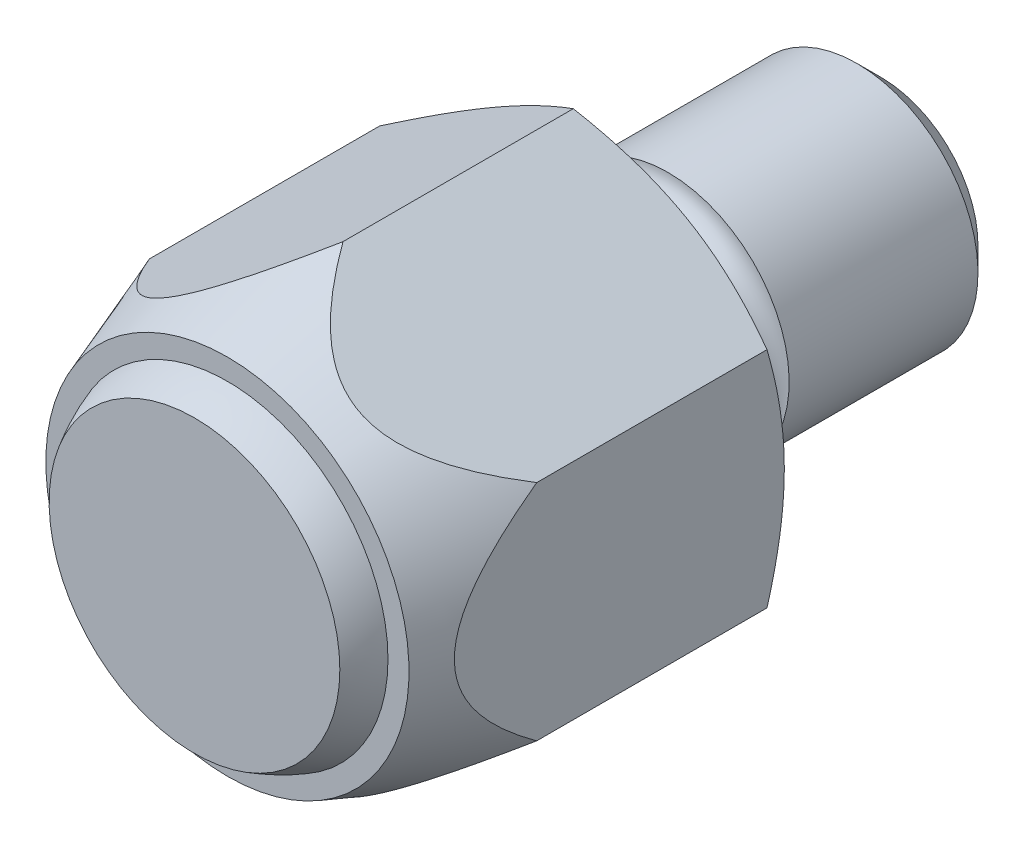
ISO-10303-21;
HEADER;
FILE_DESCRIPTION(('STEP AP214'),'2;1');
FILE_NAME('part.step','',(''),(''),'','','');
FILE_SCHEMA(('AUTOMOTIVE_DESIGN { 1 0 10303 214 1 1 1 1 }'));
ENDSEC;
DATA;
#1=APPLICATION_CONTEXT('core data for automotive mechanical design processes');
#2=APPLICATION_PROTOCOL_DEFINITION('international standard','automotive_design',2000,#1);
#3=PRODUCT_CONTEXT('',#1,'mechanical');
#4=PRODUCT('Part','Part','',(#3));
#5=PRODUCT_RELATED_PRODUCT_CATEGORY('part','',(#4));
#6=PRODUCT_DEFINITION_FORMATION('','',#4);
#7=PRODUCT_DEFINITION_CONTEXT('part definition',#1,'design');
#8=PRODUCT_DEFINITION('design','',#6,#7);
#9=PRODUCT_DEFINITION_SHAPE('','',#8);
#10=(LENGTH_UNIT() NAMED_UNIT(*) SI_UNIT(.MILLI.,.METRE.));
#11=(NAMED_UNIT(*) PLANE_ANGLE_UNIT() SI_UNIT($,.RADIAN.));
#12=(NAMED_UNIT(*) SI_UNIT($,.STERADIAN.) SOLID_ANGLE_UNIT());
#13=UNCERTAINTY_MEASURE_WITH_UNIT(LENGTH_MEASURE(1.E-05),#10,'distance_accuracy_value','');
#14=(GEOMETRIC_REPRESENTATION_CONTEXT(3) GLOBAL_UNCERTAINTY_ASSIGNED_CONTEXT((#13)) GLOBAL_UNIT_ASSIGNED_CONTEXT((#10,
#11,#12)) REPRESENTATION_CONTEXT('',''));
#15=CARTESIAN_POINT('',(0.,0.,0.));
#16=DIRECTION('',(0.,0.,1.));
#17=DIRECTION('',(1.,0.,0.));
#18=AXIS2_PLACEMENT_3D('',#15,#16,#17);
#19=CARTESIAN_POINT('',(0.,-4.61880215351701,7.5));
#20=DIRECTION('',(0.,0.,1.));
#21=DIRECTION('',(0.,-1.,0.));
#22=AXIS2_PLACEMENT_3D('',#19,#20,#21);
#23=PLANE('',#22);
#24=CARTESIAN_POINT('',(0.,0.,7.5));
#25=DIRECTION('',(0.,0.,1.));
#26=DIRECTION('',(0.,-1.,0.));
#27=AXIS2_PLACEMENT_3D('',#24,#25,#26);
#28=CIRCLE('',#27,3.75);
#29=CARTESIAN_POINT('',(0.,-3.75,7.5));
#30=VERTEX_POINT('',#29);
#31=EDGE_CURVE('E277',#30,#30,#28,.T.);
#32=ORIENTED_EDGE('',*,*,#31,.T.);
#33=EDGE_LOOP('',(#32));
#34=FACE_BOUND('',#33,.T.);
#35=CARTESIAN_POINT('',(0.,0.,7.5));
#36=DIRECTION('',(0.,0.,1.));
#37=DIRECTION('',(1.,0.,0.));
#38=AXIS2_PLACEMENT_3D('',#35,#36,#37);
#39=CIRCLE('',#38,3.31596139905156);
#40=CARTESIAN_POINT('',(3.31596139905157,0.,7.5));
#41=VERTEX_POINT('',#40);
#42=EDGE_CURVE('E18',#41,#41,#39,.F.);
#43=ORIENTED_EDGE('',*,*,#42,.T.);
#44=EDGE_LOOP('',(#43));
#45=FACE_BOUND('',#44,.T.);
#46=ADVANCED_FACE('F14',(#34,#45),#23,.T.);
#47=CARTESIAN_POINT('',(-4.,-2.30940107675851,7.5));
#48=DIRECTION('',(0.5,0.866025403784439,0.));
#49=DIRECTION('',(-0.866025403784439,0.5,0.));
#50=AXIS2_PLACEMENT_3D('',#47,#48,#49);
#51=PLANE('',#50);
#52=CARTESIAN_POINT('',(0.343567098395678,-4.81716071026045,0.478852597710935));
#53=CARTESIAN_POINT('',(0.252547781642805,-4.76461068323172,0.444856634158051));
#54=CARTESIAN_POINT('',(0.161185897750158,-4.71186287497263,0.412080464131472));
#55=CARTESIAN_POINT('',(-0.0222879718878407,-4.60593418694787,0.349347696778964));
#56=CARTESIAN_POINT('',(-0.114400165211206,-4.55275318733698,0.319391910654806));
#57=CARTESIAN_POINT('',(-0.392479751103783,-4.39220386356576,0.23417034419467));
#58=CARTESIAN_POINT('',(-0.579601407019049,-4.28416912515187,0.183775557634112));
#59=CARTESIAN_POINT('',(-0.951286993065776,-4.06957635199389,0.100776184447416));
#60=CARTESIAN_POINT('',(-1.13576962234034,-3.96306525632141,0.0677014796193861));
#61=CARTESIAN_POINT('',(-1.4136714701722,-3.8026185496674,0.0320604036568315));
#62=CARTESIAN_POINT('',(-1.50643742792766,-3.74906009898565,0.0225103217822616));
#63=CARTESIAN_POINT('',(-1.69224515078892,-3.64178396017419,0.00828055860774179));
#64=CARTESIAN_POINT('',(-1.78528688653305,-3.58806628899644,0.00360037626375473));
#65=CARTESIAN_POINT('',(-1.9812841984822,-3.47490718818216,-0.000984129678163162));
#66=CARTESIAN_POINT('',(-2.08424985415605,-3.41545993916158,-0.000332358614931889));
#67=CARTESIAN_POINT('',(-2.29001758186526,-3.29665988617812,0.0070668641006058));
#68=CARTESIAN_POINT('',(-2.39281964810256,-3.23730708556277,0.0138145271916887));
#69=CARTESIAN_POINT('',(-2.59819551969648,-3.11873327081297,0.0331980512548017));
#70=CARTESIAN_POINT('',(-2.70076855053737,-3.05951270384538,0.0458447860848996));
#71=CARTESIAN_POINT('',(-2.90529907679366,-2.94142694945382,0.0766352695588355));
#72=CARTESIAN_POINT('',(-3.00725647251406,-2.88256181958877,0.0947798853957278));
#73=CARTESIAN_POINT('',(-3.31855988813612,-2.70283070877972,0.158051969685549));
#74=CARTESIAN_POINT('',(-3.52668489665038,-2.58266967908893,0.211341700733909));
#75=CARTESIAN_POINT('',(-3.83559432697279,-2.40432073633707,0.303467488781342));
#76=CARTESIAN_POINT('',(-3.93783500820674,-2.34529205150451,0.336137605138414));
#77=CARTESIAN_POINT('',(-4.14137660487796,-2.2277772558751,0.404992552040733));
#78=CARTESIAN_POINT('',(-4.24267792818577,-2.16929090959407,0.441175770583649));
#79=CARTESIAN_POINT('',(-4.34356709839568,-2.11104252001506,0.478852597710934));
#80=B_SPLINE_CURVE_WITH_KNOTS('',3,(#52,#53,#54,#55,#56,#57,#58,#59,#60,#61,#62,#63,#64,#65,#66,
#67,#68,#69,#70,#71,#72,#73,#74,#75,#76,#77,#78,#79),.UNSPECIFIED.,.F.,.F.,(4,2,2,2,2,2,2,2,2,2,
2,2,2,4),(0.,0.33137341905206,0.662841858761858,1.32792405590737,1.97387154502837,
2.29640122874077,2.61889772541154,2.97542599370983,3.33196662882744,3.68916709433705,
4.04642393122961,4.78398762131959,5.15143679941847,5.51871816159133),.UNSPECIFIED.);
#81=CARTESIAN_POINT('',(0.,-4.61880215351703,0.35726558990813));
#82=VERTEX_POINT('',#81);
#83=CARTESIAN_POINT('',(-2.,-3.46410161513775,0.));
#84=VERTEX_POINT('',#83);
#85=EDGE_CURVE('E107',#82,#84,#80,.T.);
#86=ORIENTED_EDGE('',*,*,#85,.F.);
#87=DIRECTION('',(0.,0.,-1.));
#88=VECTOR('',#87,1.);
#89=CARTESIAN_POINT('',(0.,-4.61880215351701,7.5));
#90=LINE('',#89,#88);
#91=CARTESIAN_POINT('',(0.,-4.61880215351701,5.11298570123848));
#92=VERTEX_POINT('',#91);
#93=EDGE_CURVE('E122',#92,#82,#90,.T.);
#94=ORIENTED_EDGE('',*,*,#93,.F.);
#95=CARTESIAN_POINT('',(-4.0002,-2.30928560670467,5.11266843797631));
#96=CARTESIAN_POINT('',(-3.964136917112,-2.33010663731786,5.16987110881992));
#97=CARTESIAN_POINT('',(-3.92760255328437,-2.35119976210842,5.22667617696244));
#98=CARTESIAN_POINT('',(-3.85345694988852,-2.39400774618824,5.33936474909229));
#99=CARTESIAN_POINT('',(-3.81584542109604,-2.41572277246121,5.39524799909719));
#100=CARTESIAN_POINT('',(-3.70068543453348,-2.48221042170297,5.56205803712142));
#101=CARTESIAN_POINT('',(-3.62131565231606,-2.52803458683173,5.67133571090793));
#102=CARTESIAN_POINT('',(-3.45331044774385,-2.62503243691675,5.88773678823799));
#103=CARTESIAN_POINT('',(-3.3644356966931,-2.67634429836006,5.99461444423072));
#104=CARTESIAN_POINT('',(-3.17841664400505,-2.7837424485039,6.19795043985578));
#105=CARTESIAN_POINT('',(-3.08130020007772,-2.83981265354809,6.29444156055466));
#106=CARTESIAN_POINT('',(-2.94107270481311,-2.9207730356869,6.41539142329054));
#107=CARTESIAN_POINT('',(-2.90252363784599,-2.94302934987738,6.4469043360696));
#108=CARTESIAN_POINT('',(-2.82387348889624,-2.98843803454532,6.50724062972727));
#109=CARTESIAN_POINT('',(-2.78377207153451,-3.011590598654,6.53606342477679));
#110=CARTESIAN_POINT('',(-2.66153007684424,-3.0821670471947,6.61737170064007));
#111=CARTESIAN_POINT('',(-2.57692354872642,-3.13101464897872,6.66516877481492));
#112=CARTESIAN_POINT('',(-2.4183278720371,-3.22257990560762,6.73552635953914));
#113=CARTESIAN_POINT('',(-2.34537617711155,-3.26469858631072,6.76115649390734));
#114=CARTESIAN_POINT('',(-2.19673686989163,-3.3505155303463,6.79792026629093));
#115=CARTESIAN_POINT('',(-2.12105136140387,-3.39421257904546,6.8090648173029));
#116=CARTESIAN_POINT('',(-1.96888296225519,-3.4820670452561,6.81534471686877));
#117=CARTESIAN_POINT('',(-1.89239816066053,-3.52622556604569,6.81042089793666));
#118=CARTESIAN_POINT('',(-1.74143345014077,-3.61338508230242,6.78516348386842));
#119=CARTESIAN_POINT('',(-1.66695399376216,-3.6563858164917,6.76482644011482));
#120=CARTESIAN_POINT('',(-1.49882951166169,-3.75345253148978,6.70279125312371));
#121=CARTESIAN_POINT('',(-1.40650174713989,-3.80675799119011,6.65639340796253));
#122=CARTESIAN_POINT('',(-1.27330476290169,-3.88365930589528,6.57478478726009));
#123=CARTESIAN_POINT('',(-1.22957710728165,-3.90890547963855,6.54539715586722));
#124=CARTESIAN_POINT('',(-1.14393690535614,-3.9583498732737,6.4832929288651));
#125=CARTESIAN_POINT('',(-1.10202386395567,-3.98254837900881,6.45057724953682));
#126=CARTESIAN_POINT('',(-0.953121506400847,-4.06851719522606,6.32701655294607));
#127=CARTESIAN_POINT('',(-0.851132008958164,-4.12740085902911,6.22815008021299));
#128=CARTESIAN_POINT('',(-0.656194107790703,-4.2399483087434,6.01878702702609));
#129=CARTESIAN_POINT('',(-0.563281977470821,-4.29359115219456,5.90824718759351));
#130=CARTESIAN_POINT('',(-0.389019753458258,-4.3942014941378,5.68535303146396));
#131=CARTESIAN_POINT('',(-0.307326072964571,-4.44136736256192,5.57335369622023));
#132=CARTESIAN_POINT('',(-0.188953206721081,-4.50970996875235,5.40233500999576));
#133=CARTESIAN_POINT('',(-0.150341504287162,-4.53200244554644,5.34506864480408));
#134=CARTESIAN_POINT('',(-0.0742550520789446,-4.57593097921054,5.22956338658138));
#135=CARTESIAN_POINT('',(-0.0367799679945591,-4.59756722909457,5.17132478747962));
#136=CARTESIAN_POINT('',(0.00020000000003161,-4.61891762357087,5.11266843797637));
#137=B_SPLINE_CURVE_WITH_KNOTS('',3,(#95,#96,#97,#98,#99,#100,#101,#102,#103,#104,#105,#106,
#107,#108,#109,#110,#111,#112,#113,#114,#115,#116,#117,#118,#119,#120,#121,#122,#123,#124,#125,
#126,#127,#128,#129,#130,#131,#132,#133,#134,#135,#136),.UNSPECIFIED.,.F.,.F.,(4,2,2,2,2,2,2,2,
2,2,2,2,2,2,2,2,2,2,2,2,4),(0.,0.212255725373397,0.424568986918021,0.852183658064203,
1.29629510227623,1.73896102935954,1.90248949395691,2.06605348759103,2.39088373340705,
2.65398929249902,2.91689652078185,3.18077292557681,3.44470838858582,3.79144183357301,
3.96662096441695,4.14175199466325,4.60164843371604,5.06331329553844,5.50233228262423,
5.72004705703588,5.93769716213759),.UNSPECIFIED.);
#138=CARTESIAN_POINT('',(-4.,-2.30940107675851,5.11298570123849));
#139=VERTEX_POINT('',#138);
#140=EDGE_CURVE('E191',#139,#92,#137,.T.);
#141=ORIENTED_EDGE('',*,*,#140,.F.);
#142=DIRECTION('',(0.,0.,-1.));
#143=VECTOR('',#142,1.);
#144=CARTESIAN_POINT('',(-4.,-2.30940107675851,7.5));
#145=LINE('',#144,#143);
#146=CARTESIAN_POINT('',(-4.,-2.30940107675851,0.357265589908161));
#147=VERTEX_POINT('',#146);
#148=EDGE_CURVE('E207',#139,#147,#145,.T.);
#149=ORIENTED_EDGE('',*,*,#148,.T.);
#150=EDGE_CURVE('E178',#84,#147,#80,.T.);
#151=ORIENTED_EDGE('',*,*,#150,.F.);
#152=EDGE_LOOP('',(#86,#94,#141,#149,#151));
#153=FACE_BOUND('',#152,.T.);
#154=ADVANCED_FACE('F183',(#153),#51,.F.);
#155=CARTESIAN_POINT('',(0.,-4.61880215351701,7.5));
#156=DIRECTION('',(-0.5,0.866025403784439,0.));
#157=DIRECTION('',(-0.866025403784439,-0.5,0.));
#158=AXIS2_PLACEMENT_3D('',#155,#156,#157);
#159=PLANE('',#158);
#160=CARTESIAN_POINT('',(4.3435670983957,-2.11104252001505,0.47885259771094));
#161=CARTESIAN_POINT('',(4.25254778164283,-2.16359254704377,0.444856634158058));
#162=CARTESIAN_POINT('',(4.16118589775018,-2.21634035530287,0.412080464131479));
#163=CARTESIAN_POINT('',(3.97771202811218,-2.32226904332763,0.349347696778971));
#164=CARTESIAN_POINT('',(3.88559983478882,-2.37545004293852,0.319391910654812));
#165=CARTESIAN_POINT('',(3.60752024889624,-2.53599936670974,0.234170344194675));
#166=CARTESIAN_POINT('',(3.42039859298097,-2.64403410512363,0.183775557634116));
#167=CARTESIAN_POINT('',(3.04871300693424,-2.85862687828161,0.10077618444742));
#168=CARTESIAN_POINT('',(2.86423037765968,-2.96513797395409,0.0677014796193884));
#169=CARTESIAN_POINT('',(2.58632852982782,-3.12558468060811,0.0320604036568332));
#170=CARTESIAN_POINT('',(2.49356257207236,-3.17914313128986,0.0225103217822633));
#171=CARTESIAN_POINT('',(2.3077548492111,-3.28641927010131,0.00828055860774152));
#172=CARTESIAN_POINT('',(2.21471311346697,-3.34013694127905,0.00360037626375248));
#173=CARTESIAN_POINT('',(2.01871580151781,-3.45329604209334,-0.000984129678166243));
#174=CARTESIAN_POINT('',(1.91575014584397,-3.51274329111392,-0.000332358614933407));
#175=CARTESIAN_POINT('',(1.70998241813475,-3.63154334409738,0.0070668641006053));
#176=CARTESIAN_POINT('',(1.60718035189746,-3.69089614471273,0.0138145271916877));
#177=CARTESIAN_POINT('',(1.40180448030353,-3.80946995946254,0.0331980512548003));
#178=CARTESIAN_POINT('',(1.29923144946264,-3.86869052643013,0.0458447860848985));
#179=CARTESIAN_POINT('',(1.09470092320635,-3.98677628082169,0.0766352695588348));
#180=CARTESIAN_POINT('',(0.99274352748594,-4.04564141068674,0.0947798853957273));
#181=CARTESIAN_POINT('',(0.681440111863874,-4.22537252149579,0.158051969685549));
#182=CARTESIAN_POINT('',(0.473315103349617,-4.34553355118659,0.211341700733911));
#183=CARTESIAN_POINT('',(0.164405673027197,-4.52388249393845,0.303467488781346));
#184=CARTESIAN_POINT('',(0.0621649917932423,-4.58291117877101,0.336137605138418));
#185=CARTESIAN_POINT('',(-0.141376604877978,-4.70042597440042,0.404992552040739));
#186=CARTESIAN_POINT('',(-0.242677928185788,-4.75891232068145,0.441175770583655));
#187=CARTESIAN_POINT('',(-0.343567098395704,-4.81716071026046,0.47885259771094));
#188=B_SPLINE_CURVE_WITH_KNOTS('',3,(#160,#161,#162,#163,#164,#165,#166,#167,#168,#169,#170,
#171,#172,#173,#174,#175,#176,#177,#178,#179,#180,#181,#182,#183,#184,#185,#186,#187),
.UNSPECIFIED.,.F.,.F.,(4,2,2,2,2,2,2,2,2,2,2,2,2,4),(0.,0.331373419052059,0.662841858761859,
1.32792405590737,1.97387154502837,2.29640122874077,2.61889772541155,2.97542599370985,
3.33196662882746,3.68916709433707,4.04642393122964,4.78398762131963,5.15143679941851,
5.51871816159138),.UNSPECIFIED.);
#189=CARTESIAN_POINT('',(4.00000000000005,-2.30940107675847,0.35726558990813));
#190=VERTEX_POINT('',#189);
#191=CARTESIAN_POINT('',(2.,-3.46410161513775,0.));
#192=VERTEX_POINT('',#191);
#193=EDGE_CURVE('E86',#190,#192,#188,.T.);
#194=ORIENTED_EDGE('',*,*,#193,.F.);
#195=DIRECTION('',(0.,0.,-1.));
#196=VECTOR('',#195,1.);
#197=CARTESIAN_POINT('',(4.,-2.3094010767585,7.5));
#198=LINE('',#197,#196);
#199=CARTESIAN_POINT('',(4.,-2.3094010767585,5.11298570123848));
#200=VERTEX_POINT('',#199);
#201=EDGE_CURVE('E219',#200,#190,#198,.T.);
#202=ORIENTED_EDGE('',*,*,#201,.F.);
#203=CARTESIAN_POINT('',(-0.000200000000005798,-4.61891762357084,5.11266843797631));
#204=CARTESIAN_POINT('',(0.035863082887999,-4.59809659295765,5.16987110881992));
#205=CARTESIAN_POINT('',(0.0723974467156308,-4.57700346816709,5.22667617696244));
#206=CARTESIAN_POINT('',(0.146543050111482,-4.53419548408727,5.33936474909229));
#207=CARTESIAN_POINT('',(0.18415457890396,-4.5124804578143,5.39524799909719));
#208=CARTESIAN_POINT('',(0.299314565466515,-4.44599280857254,5.56205803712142));
#209=CARTESIAN_POINT('',(0.378684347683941,-4.40016864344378,5.67133571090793));
#210=CARTESIAN_POINT('',(0.546689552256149,-4.30317079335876,5.88773678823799));
#211=CARTESIAN_POINT('',(0.635564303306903,-4.25185893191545,5.99461444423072));
#212=CARTESIAN_POINT('',(0.821583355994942,-4.14446078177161,6.19795043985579));
#213=CARTESIAN_POINT('',(0.918699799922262,-4.08839057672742,6.29444156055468));
#214=CARTESIAN_POINT('',(1.05892729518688,-4.00743019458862,6.41539142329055));
#215=CARTESIAN_POINT('',(1.09747636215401,-3.98517388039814,6.4469043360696));
#216=CARTESIAN_POINT('',(1.17612651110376,-3.9397651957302,6.50724062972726));
#217=CARTESIAN_POINT('',(1.21622792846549,-3.91661263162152,6.53606342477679));
#218=CARTESIAN_POINT('',(1.33846992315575,-3.84603618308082,6.61737170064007));
#219=CARTESIAN_POINT('',(1.42307645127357,-3.79718858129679,6.66516877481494));
#220=CARTESIAN_POINT('',(1.58167212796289,-3.7056233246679,6.73552635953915));
#221=CARTESIAN_POINT('',(1.65462382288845,-3.6635046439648,6.76115649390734));
#222=CARTESIAN_POINT('',(1.80326313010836,-3.57768769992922,6.79792026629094));
#223=CARTESIAN_POINT('',(1.87894863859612,-3.53399065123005,6.80906481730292));
#224=CARTESIAN_POINT('',(2.0311170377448,-3.44613618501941,6.81534471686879));
#225=CARTESIAN_POINT('',(2.10760183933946,-3.40197766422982,6.81042089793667));
#226=CARTESIAN_POINT('',(2.25856654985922,-3.3148181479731,6.78516348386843));
#227=CARTESIAN_POINT('',(2.33304600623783,-3.27181741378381,6.76482644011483));
#228=CARTESIAN_POINT('',(2.5011704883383,-3.17475069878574,6.70279125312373));
#229=CARTESIAN_POINT('',(2.5934982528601,-3.1214452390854,6.65639340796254));
#230=CARTESIAN_POINT('',(2.7266952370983,-3.04454392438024,6.5747847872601));
#231=CARTESIAN_POINT('',(2.77042289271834,-3.01929775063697,6.54539715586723));
#232=CARTESIAN_POINT('',(2.85606309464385,-2.96985335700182,6.48329292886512));
#233=CARTESIAN_POINT('',(2.89797613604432,-2.9456548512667,6.45057724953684));
#234=CARTESIAN_POINT('',(3.04687849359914,-2.85968603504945,6.3270165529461));
#235=CARTESIAN_POINT('',(3.14886799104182,-2.80080237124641,6.22815008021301));
#236=CARTESIAN_POINT('',(3.34380589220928,-2.68825492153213,6.0187870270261));
#237=CARTESIAN_POINT('',(3.43671802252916,-2.63461207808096,5.90824718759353));
#238=CARTESIAN_POINT('',(3.61098024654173,-2.53400173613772,5.68535303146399));
#239=CARTESIAN_POINT('',(3.69267392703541,-2.4868358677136,5.57335369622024));
#240=CARTESIAN_POINT('',(3.81104679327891,-2.41849326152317,5.40233500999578));
#241=CARTESIAN_POINT('',(3.84965849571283,-2.39620078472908,5.3450686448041));
#242=CARTESIAN_POINT('',(3.92574494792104,-2.35227225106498,5.2295633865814));
#243=CARTESIAN_POINT('',(3.96322003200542,-2.33063600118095,5.17132478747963));
#244=CARTESIAN_POINT('',(4.0002,-2.30928560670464,5.11266843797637));
#245=B_SPLINE_CURVE_WITH_KNOTS('',3,(#203,#204,#205,#206,#207,#208,#209,#210,#211,#212,#213,
#214,#215,#216,#217,#218,#219,#220,#221,#222,#223,#224,#225,#226,#227,#228,#229,#230,#231,#232,
#233,#234,#235,#236,#237,#238,#239,#240,#241,#242,#243,#244),.UNSPECIFIED.,.F.,.F.,(4,2,2,2,2,2,
2,2,2,2,2,2,2,2,2,2,2,2,2,2,4),(0.,0.212255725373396,0.424568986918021,0.852183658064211,
1.29629510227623,1.73896102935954,1.90248949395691,2.06605348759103,2.39088373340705,
2.65398929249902,2.91689652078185,3.18077292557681,3.44470838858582,3.79144183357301,
3.96662096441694,4.14175199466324,4.60164843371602,5.06331329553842,5.50233228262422,
5.72004705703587,5.93769716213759),.UNSPECIFIED.);
#246=EDGE_CURVE('E199',#92,#200,#245,.T.);
#247=ORIENTED_EDGE('',*,*,#246,.F.);
#248=ORIENTED_EDGE('',*,*,#93,.T.);
#249=EDGE_CURVE('E99',#192,#82,#188,.T.);
#250=ORIENTED_EDGE('',*,*,#249,.F.);
#251=EDGE_LOOP('',(#194,#202,#247,#248,#250));
#252=FACE_BOUND('',#251,.T.);
#253=ADVANCED_FACE('F119',(#252),#159,.F.);
#254=CARTESIAN_POINT('',(4.,-2.3094010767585,7.5));
#255=DIRECTION('',(-1.,0.,0.));
#256=DIRECTION('',(0.,0.,-1.));
#257=AXIS2_PLACEMENT_3D('',#254,#255,#256);
#258=PLANE('',#257);
#259=CARTESIAN_POINT('',(4.,6.31354274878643,2.0057204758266));
#260=CARTESIAN_POINT('',(4.,6.1377699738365,1.92001739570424));
#261=CARTESIAN_POINT('',(4.,5.96160511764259,1.83510521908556));
#262=CARTESIAN_POINT('',(4.,5.60828291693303,1.66730577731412));
#263=CARTESIAN_POINT('',(4.,5.43112543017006,1.58441881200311));
#264=CARTESIAN_POINT('',(4.,5.07475018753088,1.42071988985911));
#265=CARTESIAN_POINT('',(4.,4.89552652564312,1.33992074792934));
#266=CARTESIAN_POINT('',(4.,4.53569046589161,1.18148843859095));
#267=CARTESIAN_POINT('',(4.,4.35507813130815,1.10385512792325));
#268=CARTESIAN_POINT('',(4.,3.98617271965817,0.950084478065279));
#269=CARTESIAN_POINT('',(4.,3.79782326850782,0.874081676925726));
#270=CARTESIAN_POINT('',(4.,3.41896233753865,0.727566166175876));
#271=CARTESIAN_POINT('',(4.,3.22845062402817,0.657054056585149));
#272=CARTESIAN_POINT('',(4.,2.84528377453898,0.523288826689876));
#273=CARTESIAN_POINT('',(4.,2.65263347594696,0.460021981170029));
#274=CARTESIAN_POINT('',(4.,2.26457078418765,0.342703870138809));
#275=CARTESIAN_POINT('',(4.,2.069159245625,0.288649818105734));
#276=CARTESIAN_POINT('',(4.,1.67646593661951,0.192538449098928));
#277=CARTESIAN_POINT('',(4.,1.47919966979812,0.150418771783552));
#278=CARTESIAN_POINT('',(4.,1.08207755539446,0.0805261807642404));
#279=CARTESIAN_POINT('',(4.,0.882222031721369,0.0527514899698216));
#280=CARTESIAN_POINT('',(4.,0.582618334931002,0.0236854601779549));
#281=CARTESIAN_POINT('',(4.,0.483456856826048,0.0161060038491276));
#282=CARTESIAN_POINT('',(4.,0.284897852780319,0.00514819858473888));
#283=CARTESIAN_POINT('',(4.,0.185500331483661,0.00176976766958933));
#284=CARTESIAN_POINT('',(4.,-0.0133504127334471,-0.00070050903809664));
#285=CARTESIAN_POINT('',(4.,-0.112803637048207,0.000207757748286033));
#286=CARTESIAN_POINT('',(4.,-0.311583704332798,0.00628664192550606));
#287=CARTESIAN_POINT('',(4.,-0.410910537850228,0.0114575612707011));
#288=CARTESIAN_POINT('',(4.,-0.646171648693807,0.0286419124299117));
#289=CARTESIAN_POINT('',(4.,-0.781975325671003,0.0424854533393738));
#290=CARTESIAN_POINT('',(4.,-1.05265890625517,0.0774141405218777));
#291=CARTESIAN_POINT('',(4.,-1.18753856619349,0.0985011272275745));
#292=CARTESIAN_POINT('',(4.,-1.59059894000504,0.171519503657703));
#293=CARTESIAN_POINT('',(4.,-1.85704145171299,0.233195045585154));
#294=CARTESIAN_POINT('',(4.,-2.25595185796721,0.341071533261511));
#295=CARTESIAN_POINT('',(4.,-2.39045799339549,0.380175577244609));
#296=CARTESIAN_POINT('',(4.,-2.65808525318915,0.462639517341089));
#297=CARTESIAN_POINT('',(4.,-2.79120713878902,0.505996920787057));
#298=CARTESIAN_POINT('',(4.,-3.05622120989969,0.596285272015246));
#299=CARTESIAN_POINT('',(4.,-3.18811340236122,0.643216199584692));
#300=CARTESIAN_POINT('',(4.,-3.45080936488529,0.740072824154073));
#301=CARTESIAN_POINT('',(4.,-3.58161299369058,0.789998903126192));
#302=CARTESIAN_POINT('',(4.,-3.88002520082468,0.90719106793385));
#303=CARTESIAN_POINT('',(4.,-4.04730712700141,0.975287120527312));
#304=CARTESIAN_POINT('',(4.,-4.38048360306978,1.11480175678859));
#305=CARTESIAN_POINT('',(4.,-4.54637807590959,1.18622052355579));
#306=CARTESIAN_POINT('',(4.,-4.87702316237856,1.33174808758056));
#307=CARTESIAN_POINT('',(4.,-5.04177351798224,1.40585746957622));
#308=CARTESIAN_POINT('',(4.,-5.37027805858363,1.55625540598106));
#309=CARTESIAN_POINT('',(4.,-5.53403222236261,1.63254400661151));
#310=CARTESIAN_POINT('',(4.,-6.02425390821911,1.86417319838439));
#311=CARTESIAN_POINT('',(4.,-6.34946137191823,2.02217935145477));
#312=CARTESIAN_POINT('',(4.,-6.99745412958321,2.34308129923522));
#313=CARTESIAN_POINT('',(4.,-7.32023932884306,2.50597728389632));
#314=CARTESIAN_POINT('',(4.,-7.96486644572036,2.8357168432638));
#315=CARTESIAN_POINT('',(4.,-8.2867035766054,3.00256975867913));
#316=CARTESIAN_POINT('',(4.,-8.92902290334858,3.33887805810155));
#317=CARTESIAN_POINT('',(4.,-9.2495050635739,3.50833351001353));
#318=CARTESIAN_POINT('',(4.,-9.88927267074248,3.8491299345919));
#319=CARTESIAN_POINT('',(4.,-10.2085586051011,4.02046999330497));
#320=CARTESIAN_POINT('',(4.,-10.8463100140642,4.36466946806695));
#321=CARTESIAN_POINT('',(4.,-11.1647754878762,4.53752888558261));
#322=CARTESIAN_POINT('',(4.,-12.0171325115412,5.00224326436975));
#323=CARTESIAN_POINT('',(4.,-12.5504339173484,5.29518022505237));
#324=CARTESIAN_POINT('',(4.,-13.6158261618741,5.88341367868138));
#325=CARTESIAN_POINT('',(4.,-14.1479168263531,6.17871048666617));
#326=CARTESIAN_POINT('',(4.,-15.2086617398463,6.76958449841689));
#327=CARTESIAN_POINT('',(4.,-15.7373203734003,7.06515383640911));
#328=CARTESIAN_POINT('',(4.,-16.7938526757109,7.65751258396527));
#329=CARTESIAN_POINT('',(4.,-17.32172644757,7.95430180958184));
#330=CARTESIAN_POINT('',(4.,-17.8493545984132,8.25152469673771));
#331=B_SPLINE_CURVE_WITH_KNOTS('',3,(#259,#260,#261,#262,#263,#264,#265,#266,#267,#268,#269,
#270,#271,#272,#273,#274,#275,#276,#277,#278,#279,#280,#281,#282,#283,#284,#285,#286,#287,#288,
#289,#290,#291,#292,#293,#294,#295,#296,#297,#298,#299,#300,#301,#302,#303,#304,#305,#306,#307,
#308,#309,#310,#311,#312,#313,#314,#315,#316,#317,#318,#319,#320,#321,#322,#323,#324,#325,#326,
#327,#328,#329,#330),.UNSPECIFIED.,.F.,.F.,(4,2,2,2,2,2,2,2,2,2,2,2,2,2,2,2,2,2,2,2,2,2,2,2,2,2,
2,2,2,2,2,2,2,2,2,4),(0.,0.586666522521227,1.17341938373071,1.76318003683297,2.35291397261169,
2.96216504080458,3.57148259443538,4.17962608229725,4.78758530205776,5.39230658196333,
5.9969529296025,6.29522966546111,6.59350058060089,6.89177932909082,7.19007920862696,
7.59937323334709,8.00877132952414,8.82804578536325,9.24823249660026,9.66817441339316,
10.0881139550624,10.5081071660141,11.0498930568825,11.5917088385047,12.1336430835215,
12.6755888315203,13.7602004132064,14.844854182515,15.9323905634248,17.0199553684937,
18.1070141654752,19.1940740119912,21.0194418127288,22.8450575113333,24.6620780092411,
26.4788338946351),.UNSPECIFIED.);
#332=CARTESIAN_POINT('',(4.00000000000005,2.30940107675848,0.357265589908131));
#333=VERTEX_POINT('',#332);
#334=CARTESIAN_POINT('',(4.,0.,0.));
#335=VERTEX_POINT('',#334);
#336=EDGE_CURVE('E30',#333,#335,#331,.T.);
#337=ORIENTED_EDGE('',*,*,#336,.F.);
#338=DIRECTION('',(0.,0.,-1.));
#339=VECTOR('',#338,1.);
#340=CARTESIAN_POINT('',(4.,2.30940107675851,7.5));
#341=LINE('',#340,#339);
#342=CARTESIAN_POINT('',(4.,2.30940107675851,5.11298570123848));
#343=VERTEX_POINT('',#342);
#344=EDGE_CURVE('E216',#343,#333,#341,.T.);
#345=ORIENTED_EDGE('',*,*,#344,.F.);
#346=CARTESIAN_POINT('',(4.,11.154023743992,-14.7533783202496));
#347=CARTESIAN_POINT('',(4.,10.8977917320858,-14.0907842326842));
#348=CARTESIAN_POINT('',(4.,10.6407321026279,-13.4285082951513));
#349=CARTESIAN_POINT('',(4.,10.1244307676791,-12.1047779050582));
#350=CARTESIAN_POINT('',(4.,9.86518897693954,-11.4433234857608));
#351=CARTESIAN_POINT('',(4.,9.34345026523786,-10.1200371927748));
#352=CARTESIAN_POINT('',(4.,9.08094749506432,-9.45820762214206));
#353=CARTESIAN_POINT('',(4.,8.55247479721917,-8.13595507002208));
#354=CARTESIAN_POINT('',(4.,8.28650496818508,-7.47553204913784));
#355=CARTESIAN_POINT('',(4.,7.7312429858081,-6.1103701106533));
#356=CARTESIAN_POINT('',(4.,7.44162139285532,-5.40576470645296));
#357=CARTESIAN_POINT('',(4.,7.001730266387,-4.35109347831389));
#358=CARTESIAN_POINT('',(4.,6.85418286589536,-3.99989235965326));
#359=CARTESIAN_POINT('',(4.,6.55689538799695,-3.29842007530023));
#360=CARTESIAN_POINT('',(4.,6.40715532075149,-2.94814890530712));
#361=CARTESIAN_POINT('',(4.,6.10521447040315,-2.24922331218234));
#362=CARTESIAN_POINT('',(4.,5.95301724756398,-1.9005673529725));
#363=CARTESIAN_POINT('',(4.,5.6453420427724,-1.20470807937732));
#364=CARTESIAN_POINT('',(4.,5.4898641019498,-0.857504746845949));
#365=CARTESIAN_POINT('',(4.,5.17479313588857,-0.16503032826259));
#366=CARTESIAN_POINT('',(4.,5.01520073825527,0.180241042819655));
#367=CARTESIAN_POINT('',(4.,4.69068820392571,0.868265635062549));
#368=CARTESIAN_POINT('',(4.,4.52576831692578,1.21101897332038));
#369=CARTESIAN_POINT('',(4.,4.26849397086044,1.73171529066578));
#370=CARTESIAN_POINT('',(4.,4.17871331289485,1.9109299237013));
#371=CARTESIAN_POINT('',(4.,3.99679626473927,2.26816934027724));
#372=CARTESIAN_POINT('',(4.,3.90465980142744,2.4461940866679));
#373=CARTESIAN_POINT('',(4.,3.71742963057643,2.80103842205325));
#374=CARTESIAN_POINT('',(4.,3.62233155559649,2.97785571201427));
#375=CARTESIAN_POINT('',(4.,3.42871327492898,3.32959757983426));
#376=CARTESIAN_POINT('',(4.,3.33019330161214,3.50452228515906));
#377=CARTESIAN_POINT('',(4.,3.1298116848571,3.85037359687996));
#378=CARTESIAN_POINT('',(4.,3.02798772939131,4.02132195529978));
#379=CARTESIAN_POINT('',(4.,2.81910077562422,4.35998234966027));
#380=CARTESIAN_POINT('',(4.,2.71203840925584,4.52769477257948));
#381=CARTESIAN_POINT('',(4.,2.49137416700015,4.85825109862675));
#382=CARTESIAN_POINT('',(4.,2.37778723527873,5.02110492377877));
#383=CARTESIAN_POINT('',(4.,2.14170967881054,5.34018010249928));
#384=CARTESIAN_POINT('',(4.,2.01922578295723,5.49640632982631));
#385=CARTESIAN_POINT('',(4.,1.82715700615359,5.72186859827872));
#386=CARTESIAN_POINT('',(4.,1.76222566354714,5.79506191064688));
#387=CARTESIAN_POINT('',(4.,1.62876289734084,5.93817440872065));
#388=CARTESIAN_POINT('',(4.,1.56022995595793,6.00809219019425));
#389=CARTESIAN_POINT('',(4.,1.41917835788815,6.14333615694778));
#390=CARTESIAN_POINT('',(4.,1.34667388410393,6.20867699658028));
#391=CARTESIAN_POINT('',(4.,1.1967874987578,6.333448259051));
#392=CARTESIAN_POINT('',(4.,1.11940965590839,6.39288350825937));
#393=CARTESIAN_POINT('',(4.,0.955388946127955,6.50620185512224));
#394=CARTESIAN_POINT('',(4.,0.868486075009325,6.55971584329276));
#395=CARTESIAN_POINT('',(4.,0.688075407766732,6.65435917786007));
#396=CARTESIAN_POINT('',(4.,0.5945739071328,6.69550013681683));
#397=CARTESIAN_POINT('',(4.,0.416471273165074,6.75596230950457));
#398=CARTESIAN_POINT('',(4.,0.332694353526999,6.77765755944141));
#399=CARTESIAN_POINT('',(4.,0.162683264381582,6.80650480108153));
#400=CARTESIAN_POINT('',(4.,0.0764520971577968,6.81367384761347));
#401=CARTESIAN_POINT('',(4.,-0.0960622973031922,6.8125214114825));
#402=CARTESIAN_POINT('',(4.,-0.182345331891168,6.80417160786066));
#403=CARTESIAN_POINT('',(4.,-0.352239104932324,6.77307088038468));
#404=CARTESIAN_POINT('',(4.,-0.43584772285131,6.75030881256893));
#405=CARTESIAN_POINT('',(4.,-0.63175275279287,6.6812810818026));
#406=CARTESIAN_POINT('',(4.,-0.741977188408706,6.62923305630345));
#407=CARTESIAN_POINT('',(4.,-0.953245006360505,6.50896940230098));
#408=CARTESIAN_POINT('',(4.,-1.05425648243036,6.44070033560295));
#409=CARTESIAN_POINT('',(4.,-1.27308226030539,6.27443818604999));
#410=CARTESIAN_POINT('',(4.,-1.38848156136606,6.17332471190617));
#411=CARTESIAN_POINT('',(4.,-1.60920940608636,5.96052533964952));
#412=CARTESIAN_POINT('',(4.,-1.71451725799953,5.84881861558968));
#413=CARTESIAN_POINT('',(4.,-1.91857291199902,5.61705811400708));
#414=CARTESIAN_POINT('',(4.,-2.01721832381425,5.49691510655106));
#415=CARTESIAN_POINT('',(4.,-2.16042231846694,5.31314546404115));
#416=CARTESIAN_POINT('',(4.,-2.20734158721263,5.25132691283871));
#417=CARTESIAN_POINT('',(4.,-2.29978558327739,5.12665734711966));
#418=CARTESIAN_POINT('',(4.,-2.34531035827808,5.06380636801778));
#419=CARTESIAN_POINT('',(4.,-2.4941334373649,4.85407701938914));
#420=CARTESIAN_POINT('',(4.,-2.59475094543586,4.70529483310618));
#421=CARTESIAN_POINT('',(4.,-2.79086547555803,4.40438020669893));
#422=CARTESIAN_POINT('',(4.,-2.88636137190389,4.25224704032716));
#423=CARTESIAN_POINT('',(4.,-3.07331717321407,3.94538549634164));
#424=CARTESIAN_POINT('',(4.,-3.16477426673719,3.79065541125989));
#425=CARTESIAN_POINT('',(4.,-3.34434814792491,3.4792646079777));
#426=CARTESIAN_POINT('',(4.,-3.43246472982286,3.32260377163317));
#427=CARTESIAN_POINT('',(4.,-3.69333741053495,2.84920192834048));
#428=CARTESIAN_POINT('',(4.,-3.861940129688,2.5301735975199));
#429=CARTESIAN_POINT('',(4.,-4.19123820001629,1.88826458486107));
#430=CARTESIAN_POINT('',(4.,-4.35193669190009,1.56538549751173));
#431=CARTESIAN_POINT('',(4.,-4.64867856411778,0.955440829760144));
#432=CARTESIAN_POINT('',(4.,-4.78537774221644,0.66869330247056));
#433=CARTESIAN_POINT('',(4.,-5.05519193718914,0.0934792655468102));
#434=CARTESIAN_POINT('',(4.,-5.18830652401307,-0.194987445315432));
#435=CARTESIAN_POINT('',(4.,-5.45065348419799,-0.771093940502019));
#436=CARTESIAN_POINT('',(4.,-5.57990734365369,-1.05872396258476));
#437=CARTESIAN_POINT('',(4.,-5.83601214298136,-1.6349929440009));
#438=CARTESIAN_POINT('',(4.,-5.96286349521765,-1.92363171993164));
#439=CARTESIAN_POINT('',(4.,-6.0887652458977,-2.21267912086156));
#440=B_SPLINE_CURVE_WITH_KNOTS('',3,(#346,#347,#348,#349,#350,#351,#352,#353,#354,#355,#356,
#357,#358,#359,#360,#361,#362,#363,#364,#365,#366,#367,#368,#369,#370,#371,#372,#373,#374,#375,
#376,#377,#378,#379,#380,#381,#382,#383,#384,#385,#386,#387,#388,#389,#390,#391,#392,#393,#394,
#395,#396,#397,#398,#399,#400,#401,#402,#403,#404,#405,#406,#407,#408,#409,#410,#411,#412,#413,
#414,#415,#416,#417,#418,#419,#420,#421,#422,#423,#424,#425,#426,#427,#428,#429,#430,#431,#432,
#433,#434,#435,#436,#437,#438,#439),.UNSPECIFIED.,.F.,.F.,(4,2,2,2,2,2,2,2,2,2,2,2,2,2,2,2,2,2,
2,2,2,2,2,2,2,2,2,2,2,2,2,2,2,2,2,2,2,2,2,2,2,2,2,2,2,2,4),(0.,2.13123922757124,
4.26256210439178,6.39851628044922,8.53440982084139,10.8197960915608,11.9625992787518,
13.1053971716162,14.2466660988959,15.3879207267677,16.5290022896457,17.6700304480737,
18.2713538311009,18.8726959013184,19.4749711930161,20.0772056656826,20.6740633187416,
21.2708491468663,21.8663187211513,22.4613425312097,22.7547812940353,23.0483447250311,
23.3409206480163,23.6332554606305,23.9387159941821,24.243888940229,24.5024139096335,
24.7606351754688,25.0193281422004,25.2782213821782,25.6418111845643,26.0066158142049,
26.465812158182,26.9259307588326,27.3919968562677,27.6248065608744,27.8576082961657,
28.3962826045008,28.9350748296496,29.4742363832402,30.0134310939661,31.0957739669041,
32.1776832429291,33.1306460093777,34.083722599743,35.0297229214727,35.9755593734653),.UNSPECIFIED.);
#441=EDGE_CURVE('E288',#200,#343,#440,.F.);
#442=ORIENTED_EDGE('',*,*,#441,.F.);
#443=ORIENTED_EDGE('',*,*,#201,.T.);
#444=EDGE_CURVE('E93',#335,#190,#331,.T.);
#445=ORIENTED_EDGE('',*,*,#444,.F.);
#446=EDGE_LOOP('',(#337,#345,#442,#443,#445));
#447=FACE_BOUND('',#446,.T.);
#448=ADVANCED_FACE('F296',(#447),#258,.F.);
#449=CARTESIAN_POINT('',(4.,2.30940107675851,7.5));
#450=DIRECTION('',(-0.5,-0.866025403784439,0.));
#451=DIRECTION('',(0.866025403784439,-0.5,0.));
#452=AXIS2_PLACEMENT_3D('',#449,#450,#451);
#453=PLANE('',#452);
#454=CARTESIAN_POINT('',(-0.343567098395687,4.81716071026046,0.478852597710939));
#455=CARTESIAN_POINT('',(-0.252547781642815,4.76461068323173,0.444856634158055));
#456=CARTESIAN_POINT('',(-0.161185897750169,4.71186287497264,0.412080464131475));
#457=CARTESIAN_POINT('',(0.022287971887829,4.60593418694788,0.349347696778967));
#458=CARTESIAN_POINT('',(0.114400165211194,4.55275318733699,0.319391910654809));
#459=CARTESIAN_POINT('',(0.392479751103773,4.39220386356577,0.234170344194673));
#460=CARTESIAN_POINT('',(0.579601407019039,4.28416912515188,0.183775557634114));
#461=CARTESIAN_POINT('',(0.951286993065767,4.0695763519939,0.100776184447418));
#462=CARTESIAN_POINT('',(1.13576962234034,3.96306525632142,0.0677014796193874));
#463=CARTESIAN_POINT('',(1.41367147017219,3.8026185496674,0.0320604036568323));
#464=CARTESIAN_POINT('',(1.50643742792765,3.74906009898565,0.0225103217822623));
#465=CARTESIAN_POINT('',(1.69224515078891,3.64178396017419,0.00828055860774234));
#466=CARTESIAN_POINT('',(1.78528688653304,3.58806628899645,0.0036003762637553));
#467=CARTESIAN_POINT('',(1.9812841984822,3.47490718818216,-0.000984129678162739));
#468=CARTESIAN_POINT('',(2.08424985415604,3.41545993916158,-0.000332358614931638));
#469=CARTESIAN_POINT('',(2.29001758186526,3.29665988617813,0.0070668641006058));
#470=CARTESIAN_POINT('',(2.39281964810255,3.23730708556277,0.0138145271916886));
#471=CARTESIAN_POINT('',(2.59819551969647,3.11873327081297,0.0331980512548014));
#472=CARTESIAN_POINT('',(2.70076855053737,3.05951270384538,0.0458447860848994));
#473=CARTESIAN_POINT('',(2.90529907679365,2.94142694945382,0.0766352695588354));
#474=CARTESIAN_POINT('',(3.00725647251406,2.88256181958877,0.0947798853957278));
#475=CARTESIAN_POINT('',(3.31855988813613,2.70283070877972,0.15805196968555));
#476=CARTESIAN_POINT('',(3.52668489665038,2.58266967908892,0.211341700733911));
#477=CARTESIAN_POINT('',(3.8355943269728,2.40432073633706,0.303467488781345));
#478=CARTESIAN_POINT('',(3.93783500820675,2.34529205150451,0.336137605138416));
#479=CARTESIAN_POINT('',(4.14137660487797,2.22777725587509,0.404992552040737));
#480=CARTESIAN_POINT('',(4.24267792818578,2.16929090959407,0.441175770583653));
#481=CARTESIAN_POINT('',(4.34356709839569,2.11104252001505,0.478852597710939));
#482=B_SPLINE_CURVE_WITH_KNOTS('',3,(#454,#455,#456,#457,#458,#459,#460,#461,#462,#463,#464,
#465,#466,#467,#468,#469,#470,#471,#472,#473,#474,#475,#476,#477,#478,#479,#480,#481),
.UNSPECIFIED.,.F.,.F.,(4,2,2,2,2,2,2,2,2,2,2,2,2,4),(0.,0.331373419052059,0.662841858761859,
1.32792405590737,1.97387154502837,2.29640122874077,2.61889772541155,2.97542599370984,
3.33196662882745,3.68916709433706,4.04642393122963,4.78398762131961,5.15143679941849,
5.51871816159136),.UNSPECIFIED.);
#483=CARTESIAN_POINT('',(0.,4.61880215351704,0.357265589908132));
#484=VERTEX_POINT('',#483);
#485=CARTESIAN_POINT('',(2.,3.46410161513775,0.));
#486=VERTEX_POINT('',#485);
#487=EDGE_CURVE('E38',#484,#486,#482,.T.);
#488=ORIENTED_EDGE('',*,*,#487,.F.);
#489=DIRECTION('',(0.,0.,-1.));
#490=VECTOR('',#489,1.);
#491=CARTESIAN_POINT('',(0.,4.61880215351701,7.5));
#492=LINE('',#491,#490);
#493=CARTESIAN_POINT('',(0.,4.61880215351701,5.11298570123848));
#494=VERTEX_POINT('',#493);
#495=EDGE_CURVE('E213',#494,#484,#492,.T.);
#496=ORIENTED_EDGE('',*,*,#495,.F.);
#497=CARTESIAN_POINT('',(4.0002,2.30928560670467,5.1126684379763));
#498=CARTESIAN_POINT('',(3.964136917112,2.33010663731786,5.16987110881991));
#499=CARTESIAN_POINT('',(3.92760255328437,2.35119976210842,5.22667617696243));
#500=CARTESIAN_POINT('',(3.85345694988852,2.39400774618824,5.33936474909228));
#501=CARTESIAN_POINT('',(3.81584542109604,2.41572277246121,5.39524799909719));
#502=CARTESIAN_POINT('',(3.70068543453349,2.48221042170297,5.56205803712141));
#503=CARTESIAN_POINT('',(3.62131565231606,2.52803458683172,5.67133571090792));
#504=CARTESIAN_POINT('',(3.45331044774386,2.62503243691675,5.88773678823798));
#505=CARTESIAN_POINT('',(3.3644356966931,2.67634429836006,5.99461444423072));
#506=CARTESIAN_POINT('',(3.17841664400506,2.7837424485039,6.19795043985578));
#507=CARTESIAN_POINT('',(3.08130020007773,2.83981265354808,6.29444156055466));
#508=CARTESIAN_POINT('',(2.94107270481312,2.92077303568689,6.41539142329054));
#509=CARTESIAN_POINT('',(2.902523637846,2.94302934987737,6.44690433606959));
#510=CARTESIAN_POINT('',(2.82387348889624,2.98843803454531,6.50724062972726));
#511=CARTESIAN_POINT('',(2.78377207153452,3.01159059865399,6.53606342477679));
#512=CARTESIAN_POINT('',(2.66153007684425,3.0821670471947,6.61737170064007));
#513=CARTESIAN_POINT('',(2.57692354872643,3.13101464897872,6.66516877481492));
#514=CARTESIAN_POINT('',(2.4183278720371,3.22257990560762,6.73552635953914));
#515=CARTESIAN_POINT('',(2.34537617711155,3.26469858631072,6.76115649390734));
#516=CARTESIAN_POINT('',(2.19673686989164,3.3505155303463,6.79792026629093));
#517=CARTESIAN_POINT('',(2.12105136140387,3.39421257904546,6.8090648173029));
#518=CARTESIAN_POINT('',(1.9688829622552,3.4820670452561,6.81534471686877));
#519=CARTESIAN_POINT('',(1.89239816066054,3.52622556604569,6.81042089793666));
#520=CARTESIAN_POINT('',(1.74143345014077,3.61338508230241,6.78516348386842));
#521=CARTESIAN_POINT('',(1.66695399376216,3.6563858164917,6.76482644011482));
#522=CARTESIAN_POINT('',(1.49882951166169,3.75345253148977,6.70279125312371));
#523=CARTESIAN_POINT('',(1.4065017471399,3.80675799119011,6.65639340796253));
#524=CARTESIAN_POINT('',(1.2733047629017,3.88365930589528,6.5747847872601));
#525=CARTESIAN_POINT('',(1.22957710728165,3.90890547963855,6.54539715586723));
#526=CARTESIAN_POINT('',(1.14393690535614,3.95834987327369,6.48329292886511));
#527=CARTESIAN_POINT('',(1.10202386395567,3.98254837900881,6.45057724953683));
#528=CARTESIAN_POINT('',(0.953121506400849,4.06851719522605,6.32701655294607));
#529=CARTESIAN_POINT('',(0.851132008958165,4.1274008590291,6.22815008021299));
#530=CARTESIAN_POINT('',(0.656194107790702,4.2399483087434,6.01878702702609));
#531=CARTESIAN_POINT('',(0.563281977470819,4.29359115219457,5.90824718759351));
#532=CARTESIAN_POINT('',(0.389019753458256,4.3942014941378,5.68535303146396));
#533=CARTESIAN_POINT('',(0.307326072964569,4.44136736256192,5.57335369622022));
#534=CARTESIAN_POINT('',(0.188953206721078,4.50970996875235,5.40233500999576));
#535=CARTESIAN_POINT('',(0.150341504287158,4.53200244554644,5.34506864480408));
#536=CARTESIAN_POINT('',(0.0742550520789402,4.57593097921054,5.22956338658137));
#537=CARTESIAN_POINT('',(0.0367799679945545,4.59756722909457,5.17132478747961));
#538=CARTESIAN_POINT('',(-0.000200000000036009,4.61891762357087,5.11266843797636));
#539=B_SPLINE_CURVE_WITH_KNOTS('',3,(#497,#498,#499,#500,#501,#502,#503,#504,#505,#506,#507,
#508,#509,#510,#511,#512,#513,#514,#515,#516,#517,#518,#519,#520,#521,#522,#523,#524,#525,#526,
#527,#528,#529,#530,#531,#532,#533,#534,#535,#536,#537,#538),.UNSPECIFIED.,.F.,.F.,(4,2,2,2,2,2,
2,2,2,2,2,2,2,2,2,2,2,2,2,2,4),(0.,0.212255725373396,0.42456898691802,0.852183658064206,
1.29629510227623,1.73896102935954,1.90248949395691,2.06605348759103,2.39088373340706,
2.65398929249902,2.91689652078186,3.18077292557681,3.44470838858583,3.79144183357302,
3.96662096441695,4.14175199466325,4.60164843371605,5.06331329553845,5.50233228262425,
5.7200470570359,5.93769716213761),.UNSPECIFIED.);
#540=EDGE_CURVE('E283',#343,#494,#539,.T.);
#541=ORIENTED_EDGE('',*,*,#540,.F.);
#542=ORIENTED_EDGE('',*,*,#344,.T.);
#543=EDGE_CURVE('E98',#486,#333,#482,.T.);
#544=ORIENTED_EDGE('',*,*,#543,.F.);
#545=EDGE_LOOP('',(#488,#496,#541,#542,#544));
#546=FACE_BOUND('',#545,.T.);
#547=ADVANCED_FACE('F293',(#546),#453,.F.);
#548=CARTESIAN_POINT('',(0.,4.61880215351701,7.5));
#549=DIRECTION('',(0.5,-0.866025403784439,0.));
#550=DIRECTION('',(0.866025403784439,0.5,0.));
#551=AXIS2_PLACEMENT_3D('',#548,#549,#550);
#552=PLANE('',#551);
#553=CARTESIAN_POINT('',(-4.34356709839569,2.11104252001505,0.478852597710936));
#554=CARTESIAN_POINT('',(-4.25254778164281,2.16359254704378,0.444856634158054));
#555=CARTESIAN_POINT('',(-4.16118589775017,2.21634035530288,0.412080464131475));
#556=CARTESIAN_POINT('',(-3.97771202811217,2.32226904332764,0.349347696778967));
#557=CARTESIAN_POINT('',(-3.8855998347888,2.37545004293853,0.319391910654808));
#558=CARTESIAN_POINT('',(-3.60752024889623,2.53599936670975,0.234170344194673));
#559=CARTESIAN_POINT('',(-3.42039859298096,2.64403410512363,0.183775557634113));
#560=CARTESIAN_POINT('',(-3.04871300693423,2.85862687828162,0.100776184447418));
#561=CARTESIAN_POINT('',(-2.86423037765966,2.9651379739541,0.0677014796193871));
#562=CARTESIAN_POINT('',(-2.58632852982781,3.12558468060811,0.0320604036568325));
#563=CARTESIAN_POINT('',(-2.49356257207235,3.17914313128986,0.0225103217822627));
#564=CARTESIAN_POINT('',(-2.30775484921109,3.28641927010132,0.0082805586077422));
#565=CARTESIAN_POINT('',(-2.21471311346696,3.34013694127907,0.00360037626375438));
#566=CARTESIAN_POINT('',(-2.0187158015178,3.45329604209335,-0.000984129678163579));
#567=CARTESIAN_POINT('',(-1.91575014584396,3.51274329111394,-0.000332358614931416));
#568=CARTESIAN_POINT('',(-1.70998241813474,3.63154334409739,0.00706686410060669));
#569=CARTESIAN_POINT('',(-1.60718035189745,3.69089614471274,0.0138145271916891));
#570=CARTESIAN_POINT('',(-1.40180448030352,3.80946995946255,0.0331980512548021));
#571=CARTESIAN_POINT('',(-1.29923144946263,3.86869052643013,0.0458447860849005));
#572=CARTESIAN_POINT('',(-1.09470092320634,3.98677628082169,0.0766352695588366));
#573=CARTESIAN_POINT('',(-0.992743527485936,4.04564141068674,0.0947798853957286));
#574=CARTESIAN_POINT('',(-0.681440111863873,4.22537252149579,0.15805196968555));
#575=CARTESIAN_POINT('',(-0.473315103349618,4.34553355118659,0.211341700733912));
#576=CARTESIAN_POINT('',(-0.164405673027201,4.52388249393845,0.303467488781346));
#577=CARTESIAN_POINT('',(-0.0621649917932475,4.58291117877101,0.336137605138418));
#578=CARTESIAN_POINT('',(0.141376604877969,4.70042597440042,0.404992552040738));
#579=CARTESIAN_POINT('',(0.242677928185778,4.75891232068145,0.441175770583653));
#580=CARTESIAN_POINT('',(0.343567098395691,4.81716071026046,0.478852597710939));
#581=B_SPLINE_CURVE_WITH_KNOTS('',3,(#553,#554,#555,#556,#557,#558,#559,#560,#561,#562,#563,
#564,#565,#566,#567,#568,#569,#570,#571,#572,#573,#574,#575,#576,#577,#578,#579,#580),
.UNSPECIFIED.,.F.,.F.,(4,2,2,2,2,2,2,2,2,2,2,2,2,4),(0.,0.331373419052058,0.662841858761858,
1.32792405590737,1.97387154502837,2.29640122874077,2.61889772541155,2.97542599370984,
3.33196662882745,3.68916709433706,4.04642393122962,4.78398762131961,5.15143679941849,
5.51871816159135),.UNSPECIFIED.);
#582=CARTESIAN_POINT('',(-4.,2.30940107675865,0.357265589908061));
#583=VERTEX_POINT('',#582);
#584=CARTESIAN_POINT('',(-2.,3.46410161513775,0.));
#585=VERTEX_POINT('',#584);
#586=EDGE_CURVE('E172',#583,#585,#581,.T.);
#587=ORIENTED_EDGE('',*,*,#586,.F.);
#588=DIRECTION('',(0.,0.,-1.));
#589=VECTOR('',#588,1.);
#590=CARTESIAN_POINT('',(-4.,2.30940107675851,7.5));
#591=LINE('',#590,#589);
#592=CARTESIAN_POINT('',(-4.,2.30940107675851,5.11298570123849));
#593=VERTEX_POINT('',#592);
#594=EDGE_CURVE('E210',#593,#583,#591,.T.);
#595=ORIENTED_EDGE('',*,*,#594,.F.);
#596=CARTESIAN_POINT('',(0.000200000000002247,4.61891762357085,5.1126684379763));
#597=CARTESIAN_POINT('',(-0.0358630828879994,4.59809659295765,5.16987110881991));
#598=CARTESIAN_POINT('',(-0.0723974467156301,4.5770034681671,5.22667617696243));
#599=CARTESIAN_POINT('',(-0.146543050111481,4.53419548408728,5.33936474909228));
#600=CARTESIAN_POINT('',(-0.184154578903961,4.5124804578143,5.39524799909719));
#601=CARTESIAN_POINT('',(-0.299314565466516,4.44599280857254,5.56205803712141));
#602=CARTESIAN_POINT('',(-0.378684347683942,4.40016864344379,5.67133571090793));
#603=CARTESIAN_POINT('',(-0.546689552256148,4.30317079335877,5.88773678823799));
#604=CARTESIAN_POINT('',(-0.6355643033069,4.25185893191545,5.99461444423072));
#605=CARTESIAN_POINT('',(-0.821583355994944,4.14446078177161,6.19795043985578));
#606=CARTESIAN_POINT('',(-0.918699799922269,4.08839057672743,6.29444156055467));
#607=CARTESIAN_POINT('',(-1.05892729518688,4.00743019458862,6.41539142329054));
#608=CARTESIAN_POINT('',(-1.09747636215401,3.98517388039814,6.44690433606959));
#609=CARTESIAN_POINT('',(-1.17612651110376,3.9397651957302,6.50724062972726));
#610=CARTESIAN_POINT('',(-1.21622792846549,3.91661263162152,6.53606342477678));
#611=CARTESIAN_POINT('',(-1.33846992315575,3.84603618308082,6.61737170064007));
#612=CARTESIAN_POINT('',(-1.42307645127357,3.79718858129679,6.66516877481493));
#613=CARTESIAN_POINT('',(-1.5816721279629,3.7056233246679,6.73552635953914));
#614=CARTESIAN_POINT('',(-1.65462382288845,3.6635046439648,6.76115649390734));
#615=CARTESIAN_POINT('',(-1.80326313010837,3.57768769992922,6.79792026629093));
#616=CARTESIAN_POINT('',(-1.87894863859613,3.53399065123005,6.80906481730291));
#617=CARTESIAN_POINT('',(-2.0311170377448,3.44613618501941,6.81534471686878));
#618=CARTESIAN_POINT('',(-2.10760183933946,3.40197766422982,6.81042089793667));
#619=CARTESIAN_POINT('',(-2.25856654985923,3.3148181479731,6.78516348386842));
#620=CARTESIAN_POINT('',(-2.33304600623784,3.27181741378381,6.76482644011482));
#621=CARTESIAN_POINT('',(-2.50117048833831,3.17475069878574,6.70279125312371));
#622=CARTESIAN_POINT('',(-2.59349825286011,3.1214452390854,6.65639340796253));
#623=CARTESIAN_POINT('',(-2.7266952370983,3.04454392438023,6.57478478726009));
#624=CARTESIAN_POINT('',(-2.77042289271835,3.01929775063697,6.54539715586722));
#625=CARTESIAN_POINT('',(-2.85606309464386,2.96985335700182,6.48329292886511));
#626=CARTESIAN_POINT('',(-2.89797613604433,2.9456548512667,6.45057724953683));
#627=CARTESIAN_POINT('',(-3.04687849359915,2.85968603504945,6.32701655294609));
#628=CARTESIAN_POINT('',(-3.14886799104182,2.80080237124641,6.228150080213));
#629=CARTESIAN_POINT('',(-3.34380589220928,2.68825492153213,6.0187870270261));
#630=CARTESIAN_POINT('',(-3.43671802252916,2.63461207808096,5.90824718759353));
#631=CARTESIAN_POINT('',(-3.61098024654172,2.53400173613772,5.68535303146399));
#632=CARTESIAN_POINT('',(-3.69267392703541,2.4868358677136,5.57335369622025));
#633=CARTESIAN_POINT('',(-3.8110467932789,2.41849326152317,5.40233500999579));
#634=CARTESIAN_POINT('',(-3.84965849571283,2.39620078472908,5.34506864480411));
#635=CARTESIAN_POINT('',(-3.92574494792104,2.35227225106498,5.2295633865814));
#636=CARTESIAN_POINT('',(-3.96322003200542,2.33063600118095,5.17132478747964));
#637=CARTESIAN_POINT('',(-4.0002,2.30928560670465,5.11266843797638));
#638=B_SPLINE_CURVE_WITH_KNOTS('',3,(#596,#597,#598,#599,#600,#601,#602,#603,#604,#605,#606,
#607,#608,#609,#610,#611,#612,#613,#614,#615,#616,#617,#618,#619,#620,#621,#622,#623,#624,#625,
#626,#627,#628,#629,#630,#631,#632,#633,#634,#635,#636,#637),.UNSPECIFIED.,.F.,.F.,(4,2,2,2,2,2,
2,2,2,2,2,2,2,2,2,2,2,2,2,2,4),(0.,0.212255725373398,0.424568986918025,0.852183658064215,
1.29629510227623,1.73896102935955,1.90248949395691,2.06605348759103,2.39088373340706,
2.65398929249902,2.91689652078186,3.18077292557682,3.44470838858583,3.79144183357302,
3.96662096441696,4.14175199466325,4.60164843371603,5.06331329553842,5.50233228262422,
5.72004705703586,5.93769716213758),.UNSPECIFIED.);
#639=EDGE_CURVE('E276',#494,#593,#638,.T.);
#640=ORIENTED_EDGE('',*,*,#639,.F.);
#641=ORIENTED_EDGE('',*,*,#495,.T.);
#642=EDGE_CURVE('E123',#585,#484,#581,.T.);
#643=ORIENTED_EDGE('',*,*,#642,.F.);
#644=EDGE_LOOP('',(#587,#595,#640,#641,#643));
#645=FACE_BOUND('',#644,.T.);
#646=ADVANCED_FACE('F265',(#645),#552,.F.);
#647=CARTESIAN_POINT('',(-4.,2.30940107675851,7.5));
#648=DIRECTION('',(1.,0.,0.));
#649=DIRECTION('',(0.,0.,1.));
#650=AXIS2_PLACEMENT_3D('',#647,#648,#649);
#651=PLANE('',#650);
#652=CARTESIAN_POINT('',(-4.,6.31354274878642,2.0057204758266));
#653=CARTESIAN_POINT('',(-4.,6.13776997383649,1.92001739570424));
#654=CARTESIAN_POINT('',(-4.,5.96160511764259,1.83510521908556));
#655=CARTESIAN_POINT('',(-4.,5.60828291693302,1.66730577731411));
#656=CARTESIAN_POINT('',(-4.,5.43112543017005,1.58441881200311));
#657=CARTESIAN_POINT('',(-4.,5.07475018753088,1.4207198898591));
#658=CARTESIAN_POINT('',(-4.,4.89552652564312,1.33992074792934));
#659=CARTESIAN_POINT('',(-4.,4.53569046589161,1.18148843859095));
#660=CARTESIAN_POINT('',(-4.,4.35507813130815,1.10385512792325));
#661=CARTESIAN_POINT('',(-4.,3.98617271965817,0.950084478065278));
#662=CARTESIAN_POINT('',(-4.,3.79782326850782,0.874081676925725));
#663=CARTESIAN_POINT('',(-4.,3.41896233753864,0.727566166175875));
#664=CARTESIAN_POINT('',(-4.,3.22845062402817,0.657054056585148));
#665=CARTESIAN_POINT('',(-4.,2.84528377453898,0.523288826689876));
#666=CARTESIAN_POINT('',(-4.,2.65263347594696,0.46002198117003));
#667=CARTESIAN_POINT('',(-4.,2.26457078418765,0.342703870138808));
#668=CARTESIAN_POINT('',(-4.,2.069159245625,0.288649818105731));
#669=CARTESIAN_POINT('',(-4.,1.67646593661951,0.192538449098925));
#670=CARTESIAN_POINT('',(-4.,1.47919966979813,0.150418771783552));
#671=CARTESIAN_POINT('',(-4.,1.08207755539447,0.0805261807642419));
#672=CARTESIAN_POINT('',(-4.,0.882222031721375,0.0527514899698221));
#673=CARTESIAN_POINT('',(-4.,0.582618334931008,0.0236854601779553));
#674=CARTESIAN_POINT('',(-4.,0.483456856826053,0.0161060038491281));
#675=CARTESIAN_POINT('',(-4.,0.284897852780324,0.00514819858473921));
#676=CARTESIAN_POINT('',(-4.,0.185500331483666,0.00176976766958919));
#677=CARTESIAN_POINT('',(-4.,-0.0133504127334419,-0.000700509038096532));
#678=CARTESIAN_POINT('',(-4.,-0.112803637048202,0.000207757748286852));
#679=CARTESIAN_POINT('',(-4.,-0.311583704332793,0.0062866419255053));
#680=CARTESIAN_POINT('',(-4.,-0.410910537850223,0.0114575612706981));
#681=CARTESIAN_POINT('',(-4.,-0.646171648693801,0.0286419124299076));
#682=CARTESIAN_POINT('',(-4.,-0.781975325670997,0.0424854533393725));
#683=CARTESIAN_POINT('',(-4.,-1.05265890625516,0.0774141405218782));
#684=CARTESIAN_POINT('',(-4.,-1.18753856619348,0.0985011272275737));
#685=CARTESIAN_POINT('',(-4.,-1.59059894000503,0.1715195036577));
#686=CARTESIAN_POINT('',(-4.,-1.85704145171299,0.233195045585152));
#687=CARTESIAN_POINT('',(-4.,-2.2559518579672,0.34107153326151));
#688=CARTESIAN_POINT('',(-4.,-2.39045799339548,0.380175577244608));
#689=CARTESIAN_POINT('',(-4.,-2.65808525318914,0.462639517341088));
#690=CARTESIAN_POINT('',(-4.,-2.79120713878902,0.505996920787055));
#691=CARTESIAN_POINT('',(-4.,-3.05622120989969,0.596285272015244));
#692=CARTESIAN_POINT('',(-4.,-3.18811340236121,0.64321619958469));
#693=CARTESIAN_POINT('',(-4.,-3.45080936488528,0.740072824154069));
#694=CARTESIAN_POINT('',(-4.,-3.58161299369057,0.789998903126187));
#695=CARTESIAN_POINT('',(-4.,-3.88002520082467,0.907191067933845));
#696=CARTESIAN_POINT('',(-4.,-4.0473071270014,0.975287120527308));
#697=CARTESIAN_POINT('',(-4.,-4.38048360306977,1.11480175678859));
#698=CARTESIAN_POINT('',(-4.,-4.54637807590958,1.18622052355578));
#699=CARTESIAN_POINT('',(-4.,-4.87702316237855,1.33174808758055));
#700=CARTESIAN_POINT('',(-4.,-5.04177351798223,1.40585746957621));
#701=CARTESIAN_POINT('',(-4.,-5.37027805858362,1.55625540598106));
#702=CARTESIAN_POINT('',(-4.,-5.5340322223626,1.6325440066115));
#703=CARTESIAN_POINT('',(-4.,-6.0242539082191,1.86417319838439));
#704=CARTESIAN_POINT('',(-4.,-6.34946137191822,2.02217935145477));
#705=CARTESIAN_POINT('',(-4.,-6.99745412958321,2.34308129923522));
#706=CARTESIAN_POINT('',(-4.,-7.32023932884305,2.50597728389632));
#707=CARTESIAN_POINT('',(-4.,-7.96486644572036,2.8357168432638));
#708=CARTESIAN_POINT('',(-4.,-8.2867035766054,3.00256975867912));
#709=CARTESIAN_POINT('',(-4.,-8.92902290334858,3.33887805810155));
#710=CARTESIAN_POINT('',(-4.,-9.2495050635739,3.50833351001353));
#711=CARTESIAN_POINT('',(-4.,-9.88927267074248,3.8491299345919));
#712=CARTESIAN_POINT('',(-4.,-10.2085586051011,4.02046999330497));
#713=CARTESIAN_POINT('',(-4.,-10.8463100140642,4.36466946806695));
#714=CARTESIAN_POINT('',(-4.,-11.1647754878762,4.53752888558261));
#715=CARTESIAN_POINT('',(-4.,-12.0171325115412,5.00224326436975));
#716=CARTESIAN_POINT('',(-4.,-12.5504339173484,5.29518022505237));
#717=CARTESIAN_POINT('',(-4.,-13.6158261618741,5.88341367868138));
#718=CARTESIAN_POINT('',(-4.,-14.1479168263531,6.17871048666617));
#719=CARTESIAN_POINT('',(-4.,-15.2086617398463,6.76958449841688));
#720=CARTESIAN_POINT('',(-4.,-15.7373203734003,7.06515383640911));
#721=CARTESIAN_POINT('',(-4.,-16.7938526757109,7.65751258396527));
#722=CARTESIAN_POINT('',(-4.,-17.32172644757,7.95430180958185));
#723=CARTESIAN_POINT('',(-4.,-17.8493545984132,8.25152469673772));
#724=B_SPLINE_CURVE_WITH_KNOTS('',3,(#652,#653,#654,#655,#656,#657,#658,#659,#660,#661,#662,
#663,#664,#665,#666,#667,#668,#669,#670,#671,#672,#673,#674,#675,#676,#677,#678,#679,#680,#681,
#682,#683,#684,#685,#686,#687,#688,#689,#690,#691,#692,#693,#694,#695,#696,#697,#698,#699,#700,
#701,#702,#703,#704,#705,#706,#707,#708,#709,#710,#711,#712,#713,#714,#715,#716,#717,#718,#719,
#720,#721,#722,#723),.UNSPECIFIED.,.F.,.F.,(4,2,2,2,2,2,2,2,2,2,2,2,2,2,2,2,2,2,2,2,2,2,2,2,2,2,
2,2,2,2,2,2,2,2,2,4),(0.,0.586666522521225,1.1734193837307,1.76318003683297,2.35291397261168,
2.96216504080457,3.57148259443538,4.17962608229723,4.78758530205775,5.39230658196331,
5.99695292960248,6.2952296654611,6.59350058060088,6.8917793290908,7.19007920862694,
7.59937323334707,8.00877132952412,8.82804578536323,9.24823249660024,9.66817441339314,
10.0881139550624,10.5081071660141,11.0498930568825,11.5917088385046,12.1336430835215,
12.6755888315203,13.7602004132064,14.844854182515,15.9323905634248,17.0199553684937,
18.1070141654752,19.1940740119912,21.0194418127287,22.8450575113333,24.6620780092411,
26.4788338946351),.UNSPECIFIED.);
#725=CARTESIAN_POINT('',(-4.,0.,0.));
#726=VERTEX_POINT('',#725);
#727=EDGE_CURVE('E322',#147,#726,#724,.F.);
#728=ORIENTED_EDGE('',*,*,#727,.F.);
#729=ORIENTED_EDGE('',*,*,#148,.F.);
#730=CARTESIAN_POINT('',(-4.,11.154023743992,-14.7533783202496));
#731=CARTESIAN_POINT('',(-4.,10.8977917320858,-14.0907842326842));
#732=CARTESIAN_POINT('',(-4.,10.6407321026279,-13.4285082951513));
#733=CARTESIAN_POINT('',(-4.,10.1244307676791,-12.1047779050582));
#734=CARTESIAN_POINT('',(-4.,9.86518897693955,-11.4433234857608));
#735=CARTESIAN_POINT('',(-4.,9.34345026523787,-10.1200371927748));
#736=CARTESIAN_POINT('',(-4.,9.08094749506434,-9.45820762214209));
#737=CARTESIAN_POINT('',(-4.,8.55247479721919,-8.13595507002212));
#738=CARTESIAN_POINT('',(-4.,8.2865049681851,-7.47553204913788));
#739=CARTESIAN_POINT('',(-4.,7.73124298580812,-6.11037011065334));
#740=CARTESIAN_POINT('',(-4.,7.44162139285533,-5.405764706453));
#741=CARTESIAN_POINT('',(-4.,7.00173026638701,-4.35109347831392));
#742=CARTESIAN_POINT('',(-4.,6.85418286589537,-3.9998923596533));
#743=CARTESIAN_POINT('',(-4.,6.55689538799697,-3.29842007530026));
#744=CARTESIAN_POINT('',(-4.,6.4071553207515,-2.94814890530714));
#745=CARTESIAN_POINT('',(-4.,6.10521447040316,-2.24922331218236));
#746=CARTESIAN_POINT('',(-4.,5.95301724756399,-1.90056735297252));
#747=CARTESIAN_POINT('',(-4.,5.6453420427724,-1.20470807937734));
#748=CARTESIAN_POINT('',(-4.,5.48986410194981,-0.857504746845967));
#749=CARTESIAN_POINT('',(-4.,5.17479313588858,-0.165030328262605));
#750=CARTESIAN_POINT('',(-4.,5.01520073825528,0.180241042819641));
#751=CARTESIAN_POINT('',(-4.,4.69068820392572,0.86826563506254));
#752=CARTESIAN_POINT('',(-4.,4.52576831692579,1.21101897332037));
#753=CARTESIAN_POINT('',(-4.,4.26849397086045,1.73171529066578));
#754=CARTESIAN_POINT('',(-4.,4.17871331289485,1.9109299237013));
#755=CARTESIAN_POINT('',(-4.,3.99679626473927,2.26816934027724));
#756=CARTESIAN_POINT('',(-4.,3.90465980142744,2.44619408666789));
#757=CARTESIAN_POINT('',(-4.,3.71742963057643,2.80103842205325));
#758=CARTESIAN_POINT('',(-4.,3.6223315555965,2.97785571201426));
#759=CARTESIAN_POINT('',(-4.,3.42871327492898,3.32959757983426));
#760=CARTESIAN_POINT('',(-4.,3.33019330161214,3.50452228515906));
#761=CARTESIAN_POINT('',(-4.,3.1298116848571,3.85037359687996));
#762=CARTESIAN_POINT('',(-4.,3.02798772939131,4.02132195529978));
#763=CARTESIAN_POINT('',(-4.,2.81910077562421,4.35998234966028));
#764=CARTESIAN_POINT('',(-4.,2.71203840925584,4.52769477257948));
#765=CARTESIAN_POINT('',(-4.,2.49137416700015,4.85825109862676));
#766=CARTESIAN_POINT('',(-4.,2.37778723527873,5.02110492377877));
#767=CARTESIAN_POINT('',(-4.,2.14170967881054,5.34018010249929));
#768=CARTESIAN_POINT('',(-4.,2.01922578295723,5.49640632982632));
#769=CARTESIAN_POINT('',(-4.,1.82715700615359,5.72186859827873));
#770=CARTESIAN_POINT('',(-4.,1.76222566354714,5.79506191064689));
#771=CARTESIAN_POINT('',(-4.,1.62876289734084,5.93817440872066));
#772=CARTESIAN_POINT('',(-4.,1.56022995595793,6.00809219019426));
#773=CARTESIAN_POINT('',(-4.,1.41917835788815,6.14333615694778));
#774=CARTESIAN_POINT('',(-4.,1.34667388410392,6.20867699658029));
#775=CARTESIAN_POINT('',(-4.,1.19678749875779,6.33344825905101));
#776=CARTESIAN_POINT('',(-4.,1.11940965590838,6.39288350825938));
#777=CARTESIAN_POINT('',(-4.,0.95538894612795,6.50620185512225));
#778=CARTESIAN_POINT('',(-4.,0.868486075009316,6.55971584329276));
#779=CARTESIAN_POINT('',(-4.,0.688075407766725,6.65435917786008));
#780=CARTESIAN_POINT('',(-4.,0.5945739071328,6.69550013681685));
#781=CARTESIAN_POINT('',(-4.,0.416471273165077,6.75596230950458));
#782=CARTESIAN_POINT('',(-4.,0.332694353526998,6.77765755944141));
#783=CARTESIAN_POINT('',(-4.,0.16268326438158,6.80650480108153));
#784=CARTESIAN_POINT('',(-4.,0.0764520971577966,6.81367384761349));
#785=CARTESIAN_POINT('',(-4.,-0.0960622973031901,6.81252141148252));
#786=CARTESIAN_POINT('',(-4.,-0.182345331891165,6.80417160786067));
#787=CARTESIAN_POINT('',(-4.,-0.352239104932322,6.77307088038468));
#788=CARTESIAN_POINT('',(-4.,-0.435847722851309,6.75030881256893));
#789=CARTESIAN_POINT('',(-4.,-0.631752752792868,6.68128108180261));
#790=CARTESIAN_POINT('',(-4.,-0.741977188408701,6.62923305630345));
#791=CARTESIAN_POINT('',(-4.,-0.953245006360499,6.50896940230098));
#792=CARTESIAN_POINT('',(-4.,-1.05425648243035,6.44070033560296));
#793=CARTESIAN_POINT('',(-4.,-1.27308226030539,6.27443818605));
#794=CARTESIAN_POINT('',(-4.,-1.38848156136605,6.17332471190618));
#795=CARTESIAN_POINT('',(-4.,-1.60920940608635,5.96052533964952));
#796=CARTESIAN_POINT('',(-4.,-1.71451725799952,5.84881861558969));
#797=CARTESIAN_POINT('',(-4.,-1.91857291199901,5.61705811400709));
#798=CARTESIAN_POINT('',(-4.,-2.01721832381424,5.49691510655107));
#799=CARTESIAN_POINT('',(-4.,-2.16042231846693,5.31314546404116));
#800=CARTESIAN_POINT('',(-4.,-2.20734158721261,5.25132691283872));
#801=CARTESIAN_POINT('',(-4.,-2.29978558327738,5.12665734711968));
#802=CARTESIAN_POINT('',(-4.,-2.34531035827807,5.06380636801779));
#803=CARTESIAN_POINT('',(-4.,-2.4941334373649,4.85407701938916));
#804=CARTESIAN_POINT('',(-4.,-2.59475094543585,4.7052948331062));
#805=CARTESIAN_POINT('',(-4.,-2.79086547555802,4.40438020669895));
#806=CARTESIAN_POINT('',(-4.,-2.88636137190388,4.25224704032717));
#807=CARTESIAN_POINT('',(-4.,-3.07331717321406,3.94538549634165));
#808=CARTESIAN_POINT('',(-4.,-3.16477426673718,3.7906554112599));
#809=CARTESIAN_POINT('',(-4.,-3.3443481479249,3.47926460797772));
#810=CARTESIAN_POINT('',(-4.,-3.43246472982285,3.32260377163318));
#811=CARTESIAN_POINT('',(-4.,-3.69333741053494,2.84920192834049));
#812=CARTESIAN_POINT('',(-4.,-3.861940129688,2.53017359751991));
#813=CARTESIAN_POINT('',(-4.,-4.19123820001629,1.88826458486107));
#814=CARTESIAN_POINT('',(-4.,-4.35193669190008,1.56538549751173));
#815=CARTESIAN_POINT('',(-4.,-4.64867856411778,0.955440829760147));
#816=CARTESIAN_POINT('',(-4.,-4.78537774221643,0.668693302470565));
#817=CARTESIAN_POINT('',(-4.,-5.05519193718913,0.0934792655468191));
#818=CARTESIAN_POINT('',(-4.,-5.18830652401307,-0.194987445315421));
#819=CARTESIAN_POINT('',(-4.,-5.45065348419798,-0.771093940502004));
#820=CARTESIAN_POINT('',(-4.,-5.57990734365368,-1.05872396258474));
#821=CARTESIAN_POINT('',(-4.,-5.83601214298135,-1.63499294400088));
#822=CARTESIAN_POINT('',(-4.,-5.96286349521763,-1.92363171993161));
#823=CARTESIAN_POINT('',(-4.,-6.08876524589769,-2.21267912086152));
#824=B_SPLINE_CURVE_WITH_KNOTS('',3,(#730,#731,#732,#733,#734,#735,#736,#737,#738,#739,#740,
#741,#742,#743,#744,#745,#746,#747,#748,#749,#750,#751,#752,#753,#754,#755,#756,#757,#758,#759,
#760,#761,#762,#763,#764,#765,#766,#767,#768,#769,#770,#771,#772,#773,#774,#775,#776,#777,#778,
#779,#780,#781,#782,#783,#784,#785,#786,#787,#788,#789,#790,#791,#792,#793,#794,#795,#796,#797,
#798,#799,#800,#801,#802,#803,#804,#805,#806,#807,#808,#809,#810,#811,#812,#813,#814,#815,#816,
#817,#818,#819,#820,#821,#822,#823),.UNSPECIFIED.,.F.,.F.,(4,2,2,2,2,2,2,2,2,2,2,2,2,2,2,2,2,2,
2,2,2,2,2,2,2,2,2,2,2,2,2,2,2,2,2,2,2,2,2,2,2,2,2,2,2,2,4),(0.,2.13123922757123,
4.26256210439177,6.3985162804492,8.53440982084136,10.8197960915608,11.9625992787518,
13.1053971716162,14.2466660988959,15.3879207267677,16.5290022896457,17.6700304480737,
18.2713538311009,18.8726959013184,19.4749711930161,20.0772056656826,20.6740633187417,
21.2708491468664,21.8663187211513,22.4613425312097,22.7547812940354,23.0483447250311,
23.3409206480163,23.6332554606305,23.9387159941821,24.2438889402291,24.5024139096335,
24.7606351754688,25.0193281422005,25.2782213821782,25.6418111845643,26.0066158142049,
26.465812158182,26.9259307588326,27.3919968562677,27.6248065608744,27.8576082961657,
28.3962826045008,28.9350748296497,29.4742363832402,30.0134310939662,31.0957739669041,
32.1776832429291,33.1306460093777,34.083722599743,35.0297229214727,35.9755593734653),.UNSPECIFIED.);
#825=EDGE_CURVE('E270',#593,#139,#824,.T.);
#826=ORIENTED_EDGE('',*,*,#825,.F.);
#827=ORIENTED_EDGE('',*,*,#594,.T.);
#828=EDGE_CURVE('E163',#726,#583,#724,.F.);
#829=ORIENTED_EDGE('',*,*,#828,.F.);
#830=EDGE_LOOP('',(#728,#729,#826,#827,#829));
#831=FACE_BOUND('',#830,.T.);
#832=ADVANCED_FACE('F262',(#831),#651,.F.);
#833=CARTESIAN_POINT('',(0.,0.,7.5));
#834=DIRECTION('',(0.,0.,-1.));
#835=DIRECTION('',(0.,-1.,0.));
#836=AXIS2_PLACEMENT_3D('',#833,#834,#835);
#837=CONICAL_SURFACE('',#836,3.75,0.349065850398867);
#838=ORIENTED_EDGE('',*,*,#31,.F.);
#839=EDGE_LOOP('',(#838));
#840=FACE_BOUND('',#839,.T.);
#841=ORIENTED_EDGE('',*,*,#140,.T.);
#842=ORIENTED_EDGE('',*,*,#246,.T.);
#843=ORIENTED_EDGE('',*,*,#441,.T.);
#844=ORIENTED_EDGE('',*,*,#540,.T.);
#845=ORIENTED_EDGE('',*,*,#639,.T.);
#846=ORIENTED_EDGE('',*,*,#825,.T.);
#847=EDGE_LOOP('',(#841,#842,#843,#844,#845,#846));
#848=FACE_BOUND('',#847,.T.);
#849=ADVANCED_FACE('F155',(#840,#848),#837,.T.);
#850=CARTESIAN_POINT('',(0.,0.,0.));
#851=DIRECTION('',(0.,0.,1.));
#852=DIRECTION('',(0.,1.,0.));
#853=AXIS2_PLACEMENT_3D('',#850,#851,#852);
#854=CONICAL_SURFACE('',#853,4.,1.0471975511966);
#855=ORIENTED_EDGE('',*,*,#249,.T.);
#856=ORIENTED_EDGE('',*,*,#85,.T.);
#857=CARTESIAN_POINT('',(0.,0.,0.));
#858=DIRECTION('',(0.,0.,1.));
#859=DIRECTION('',(0.,-1.,0.));
#860=AXIS2_PLACEMENT_3D('',#857,#858,#859);
#861=CIRCLE('',#860,4.);
#862=EDGE_CURVE('E104',#84,#192,#861,.T.);
#863=ORIENTED_EDGE('',*,*,#862,.T.);
#864=EDGE_LOOP('',(#855,#856,#863));
#865=FACE_BOUND('',#864,.T.);
#866=ADVANCED_FACE('F105',(#865),#854,.T.);
#867=ORIENTED_EDGE('',*,*,#150,.T.);
#868=ORIENTED_EDGE('',*,*,#727,.T.);
#869=EDGE_CURVE('E110',#726,#84,#861,.T.);
#870=ORIENTED_EDGE('',*,*,#869,.T.);
#871=EDGE_LOOP('',(#867,#868,#870));
#872=FACE_BOUND('',#871,.T.);
#873=ADVANCED_FACE('F411',(#872),#854,.T.);
#874=ORIENTED_EDGE('',*,*,#586,.T.);
#875=EDGE_CURVE('E496',#585,#726,#861,.T.);
#876=ORIENTED_EDGE('',*,*,#875,.T.);
#877=ORIENTED_EDGE('',*,*,#828,.T.);
#878=EDGE_LOOP('',(#874,#876,#877));
#879=FACE_BOUND('',#878,.T.);
#880=ADVANCED_FACE('F152',(#879),#854,.T.);
#881=ORIENTED_EDGE('',*,*,#487,.T.);
#882=EDGE_CURVE('E117',#486,#585,#861,.T.);
#883=ORIENTED_EDGE('',*,*,#882,.T.);
#884=ORIENTED_EDGE('',*,*,#642,.T.);
#885=EDGE_LOOP('',(#881,#883,#884));
#886=FACE_BOUND('',#885,.T.);
#887=ADVANCED_FACE('F151',(#886),#854,.T.);
#888=ORIENTED_EDGE('',*,*,#336,.T.);
#889=CARTESIAN_POINT('',(0.,0.,0.));
#890=DIRECTION('',(0.,0.,-1.));
#891=DIRECTION('',(0.,1.,0.));
#892=AXIS2_PLACEMENT_3D('',#889,#890,#891);
#893=CIRCLE('',#892,4.);
#894=EDGE_CURVE('E115',#486,#335,#893,.T.);
#895=ORIENTED_EDGE('',*,*,#894,.F.);
#896=ORIENTED_EDGE('',*,*,#543,.T.);
#897=EDGE_LOOP('',(#888,#895,#896));
#898=FACE_BOUND('',#897,.T.);
#899=ADVANCED_FACE('F146',(#898),#854,.T.);
#900=ORIENTED_EDGE('',*,*,#444,.T.);
#901=ORIENTED_EDGE('',*,*,#193,.T.);
#902=EDGE_CURVE('E90',#192,#335,#861,.T.);
#903=ORIENTED_EDGE('',*,*,#902,.T.);
#904=EDGE_LOOP('',(#900,#901,#903));
#905=FACE_BOUND('',#904,.T.);
#906=ADVANCED_FACE('F88',(#905),#854,.T.);
#907=CARTESIAN_POINT('',(0.,0.,-6.));
#908=DIRECTION('',(0.,0.,-1.));
#909=DIRECTION('',(0.,1.,0.));
#910=AXIS2_PLACEMENT_3D('',#907,#908,#909);
#911=PLANE('',#910);
#912=CARTESIAN_POINT('',(0.,0.,-6.));
#913=DIRECTION('',(0.,0.,-1.));
#914=DIRECTION('',(0.,1.,0.));
#915=AXIS2_PLACEMENT_3D('',#912,#913,#914);
#916=CIRCLE('',#915,2.);
#917=CARTESIAN_POINT('',(0.,2.,-6.));
#918=VERTEX_POINT('',#917);
#919=EDGE_CURVE('E222',#918,#918,#916,.T.);
#920=ORIENTED_EDGE('',*,*,#919,.T.);
#921=EDGE_LOOP('',(#920));
#922=FACE_BOUND('',#921,.T.);
#923=ADVANCED_FACE('F250',(#922),#911,.T.);
#924=CARTESIAN_POINT('',(0.,0.,-6.));
#925=DIRECTION('',(0.,0.,1.));
#926=DIRECTION('',(0.,-1.,0.));
#927=AXIS2_PLACEMENT_3D('',#924,#925,#926);
#928=CONICAL_SURFACE('',#927,2.,0.785398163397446);
#929=CARTESIAN_POINT('',(0.,0.,-5.5));
#930=DIRECTION('',(0.,0.,-1.));
#931=DIRECTION('',(0.,1.,0.));
#932=AXIS2_PLACEMENT_3D('',#929,#930,#931);
#933=CIRCLE('',#932,2.5);
#934=CARTESIAN_POINT('',(0.,2.5,-5.5));
#935=VERTEX_POINT('',#934);
#936=EDGE_CURVE('E111',#935,#935,#933,.F.);
#937=ORIENTED_EDGE('',*,*,#936,.F.);
#938=EDGE_LOOP('',(#937));
#939=FACE_BOUND('',#938,.T.);
#940=ORIENTED_EDGE('',*,*,#919,.F.);
#941=EDGE_LOOP('',(#940));
#942=FACE_BOUND('',#941,.T.);
#943=ADVANCED_FACE('F188',(#939,#942),#928,.T.);
#944=CARTESIAN_POINT('',(0.,0.,-6.));
#945=DIRECTION('',(0.,0.,1.));
#946=DIRECTION('',(0.,-1.,0.));
#947=AXIS2_PLACEMENT_3D('',#944,#945,#946);
#948=CYLINDRICAL_SURFACE('',#947,2.5);
#949=ORIENTED_EDGE('',*,*,#936,.T.);
#950=EDGE_LOOP('',(#949));
#951=FACE_BOUND('',#950,.T.);
#952=CARTESIAN_POINT('',(0.,0.,-1.6));
#953=DIRECTION('',(0.,0.,-1.));
#954=DIRECTION('',(0.,1.,0.));
#955=AXIS2_PLACEMENT_3D('',#952,#953,#954);
#956=CIRCLE('',#955,2.5);
#957=CARTESIAN_POINT('',(0.,2.5,-1.6));
#958=VERTEX_POINT('',#957);
#959=EDGE_CURVE('E198',#958,#958,#956,.T.);
#960=ORIENTED_EDGE('',*,*,#959,.T.);
#961=EDGE_LOOP('',(#960));
#962=FACE_BOUND('',#961,.T.);
#963=ADVANCED_FACE('F240',(#951,#962),#948,.T.);
#964=CARTESIAN_POINT('',(0.,0.,-1.6));
#965=DIRECTION('',(0.,0.,1.));
#966=DIRECTION('',(0.,-1.,0.));
#967=AXIS2_PLACEMENT_3D('',#964,#965,#966);
#968=CYLINDRICAL_SURFACE('',#967,2.);
#969=CARTESIAN_POINT('',(0.,0.,-1.1));
#970=DIRECTION('',(0.,0.,-1.));
#971=DIRECTION('',(0.,1.,0.));
#972=AXIS2_PLACEMENT_3D('',#969,#970,#971);
#973=CIRCLE('',#972,2.);
#974=CARTESIAN_POINT('',(0.,2.,-1.1));
#975=VERTEX_POINT('',#974);
#976=EDGE_CURVE('E23',#975,#975,#973,.F.);
#977=ORIENTED_EDGE('',*,*,#976,.T.);
#978=EDGE_LOOP('',(#977));
#979=FACE_BOUND('',#978,.T.);
#980=CARTESIAN_POINT('',(0.,0.,-0.5));
#981=DIRECTION('',(0.,0.,1.));
#982=DIRECTION('',(0.,-1.,0.));
#983=AXIS2_PLACEMENT_3D('',#980,#981,#982);
#984=CIRCLE('',#983,2.);
#985=CARTESIAN_POINT('',(0.,-2.,-0.5));
#986=VERTEX_POINT('',#985);
#987=EDGE_CURVE('E116',#986,#986,#984,.F.);
#988=ORIENTED_EDGE('',*,*,#987,.T.);
#989=EDGE_LOOP('',(#988));
#990=FACE_BOUND('',#989,.T.);
#991=ADVANCED_FACE('F232',(#979,#990),#968,.T.);
#992=CARTESIAN_POINT('',(0.,-4.61880215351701,0.));
#993=DIRECTION('',(0.,0.,1.));
#994=DIRECTION('',(0.,-1.,0.));
#995=AXIS2_PLACEMENT_3D('',#992,#993,#994);
#996=PLANE('',#995);
#997=CARTESIAN_POINT('',(0.,0.,0.));
#998=DIRECTION('',(0.,0.,1.));
#999=DIRECTION('',(0.,-1.,0.));
#1000=AXIS2_PLACEMENT_3D('',#997,#998,#999);
#1001=CIRCLE('',#1000,2.5);
#1002=CARTESIAN_POINT('',(0.,-2.5,0.));
#1003=VERTEX_POINT('',#1002);
#1004=EDGE_CURVE('E9',#1003,#1003,#1001,.T.);
#1005=ORIENTED_EDGE('',*,*,#1004,.T.);
#1006=EDGE_LOOP('',(#1005));
#1007=FACE_BOUND('',#1006,.T.);
#1008=ORIENTED_EDGE('',*,*,#902,.F.);
#1009=ORIENTED_EDGE('',*,*,#862,.F.);
#1010=ORIENTED_EDGE('',*,*,#869,.F.);
#1011=ORIENTED_EDGE('',*,*,#875,.F.);
#1012=ORIENTED_EDGE('',*,*,#882,.F.);
#1013=ORIENTED_EDGE('',*,*,#894,.T.);
#1014=EDGE_LOOP('',(#1008,#1009,#1010,#1011,#1012,#1013));
#1015=FACE_BOUND('',#1014,.T.);
#1016=ADVANCED_FACE('F113',(#1007,#1015),#996,.F.);
#1017=CARTESIAN_POINT('',(0.,0.,-1.1));
#1018=DIRECTION('',(0.,0.,-1.));
#1019=DIRECTION('',(0.,1.,0.));
#1020=AXIS2_PLACEMENT_3D('',#1017,#1018,#1019);
#1021=TOROIDAL_SURFACE('',#1020,2.5,0.5);
#1022=ORIENTED_EDGE('',*,*,#976,.F.);
#1023=EDGE_LOOP('',(#1022));
#1024=FACE_BOUND('',#1023,.T.);
#1025=ORIENTED_EDGE('',*,*,#959,.F.);
#1026=EDGE_LOOP('',(#1025));
#1027=FACE_BOUND('',#1026,.T.);
#1028=ADVANCED_FACE('F235',(#1024,#1027),#1021,.F.);
#1029=CARTESIAN_POINT('',(0.,0.,-0.5));
#1030=DIRECTION('',(0.,0.,1.));
#1031=DIRECTION('',(0.,-1.,0.));
#1032=AXIS2_PLACEMENT_3D('',#1029,#1030,#1031);
#1033=TOROIDAL_SURFACE('',#1032,2.5,0.5);
#1034=ORIENTED_EDGE('',*,*,#1004,.F.);
#1035=EDGE_LOOP('',(#1034));
#1036=FACE_BOUND('',#1035,.T.);
#1037=ORIENTED_EDGE('',*,*,#987,.F.);
#1038=EDGE_LOOP('',(#1037));
#1039=FACE_BOUND('',#1038,.T.);
#1040=ADVANCED_FACE('F16',(#1036,#1039),#1033,.F.);
#1041=CARTESIAN_POINT('',(0.,0.,6.38));
#1042=DIRECTION('',(0.,1.,0.));
#1043=DIRECTION('',(0.,0.,1.));
#1044=AXIS2_PLACEMENT_3D('',#1041,#1042,#1043);
#1045=SPHERICAL_SURFACE('',#1044,3.5);
#1046=CARTESIAN_POINT('',(0.,0.,6.38));
#1047=DIRECTION('',(0.,0.,1.));
#1048=DIRECTION('',(1.,0.,0.));
#1049=AXIS2_PLACEMENT_3D('',#1046,#1047,#1048);
#1050=SPHERICAL_SURFACE('',#1049,3.5);
#1051=ORIENTED_EDGE('',*,*,#42,.F.);
#1052=EDGE_LOOP('',(#1051));
#1053=FACE_BOUND('',#1052,.T.);
#1054=CARTESIAN_POINT('',(0.,0.,8.18));
#1055=DIRECTION('',(0.,0.,1.));
#1056=DIRECTION('',(0.,1.,0.));
#1057=AXIS2_PLACEMENT_3D('',#1054,#1055,#1056);
#1058=CIRCLE('',#1057,3.00166620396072);
#1059=CARTESIAN_POINT('',(0.,3.00166620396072,8.18));
#1060=VERTEX_POINT('',#1059);
#1061=EDGE_CURVE('E328',#1060,#1060,#1058,.T.);
#1062=ORIENTED_EDGE('',*,*,#1061,.F.);
#1063=EDGE_LOOP('',(#1062));
#1064=FACE_BOUND('',#1063,.T.);
#1065=ADVANCED_FACE('F334',(#1053,#1064),#1050,.T.);
#1066=CARTESIAN_POINT('',(-12.5,-3.00166620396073,8.18));
#1067=DIRECTION('',(0.,0.,1.));
#1068=DIRECTION('',(0.,1.,0.));
#1069=AXIS2_PLACEMENT_3D('',#1066,#1067,#1068);
#1070=PLANE('',#1069);
#1071=ORIENTED_EDGE('',*,*,#1061,.T.);
#1072=EDGE_LOOP('',(#1071));
#1073=FACE_BOUND('',#1072,.T.);
#1074=ADVANCED_FACE('F153',(#1073),#1070,.T.);
#1075=CLOSED_SHELL('',(#46,#154,#253,#448,#547,#646,#832,#849,#866,#873,#880,#887,#899,#906,
#923,#943,#963,#991,#1016,#1028,#1040,#1065,#1074));
#1076=MANIFOLD_SOLID_BREP('B1',#1075);
#1077=ADVANCED_BREP_SHAPE_REPRESENTATION('',(#18,#1076),#14);
#1078=SHAPE_DEFINITION_REPRESENTATION(#9,#1077);
ENDSEC;
END-ISO-10303-21;
